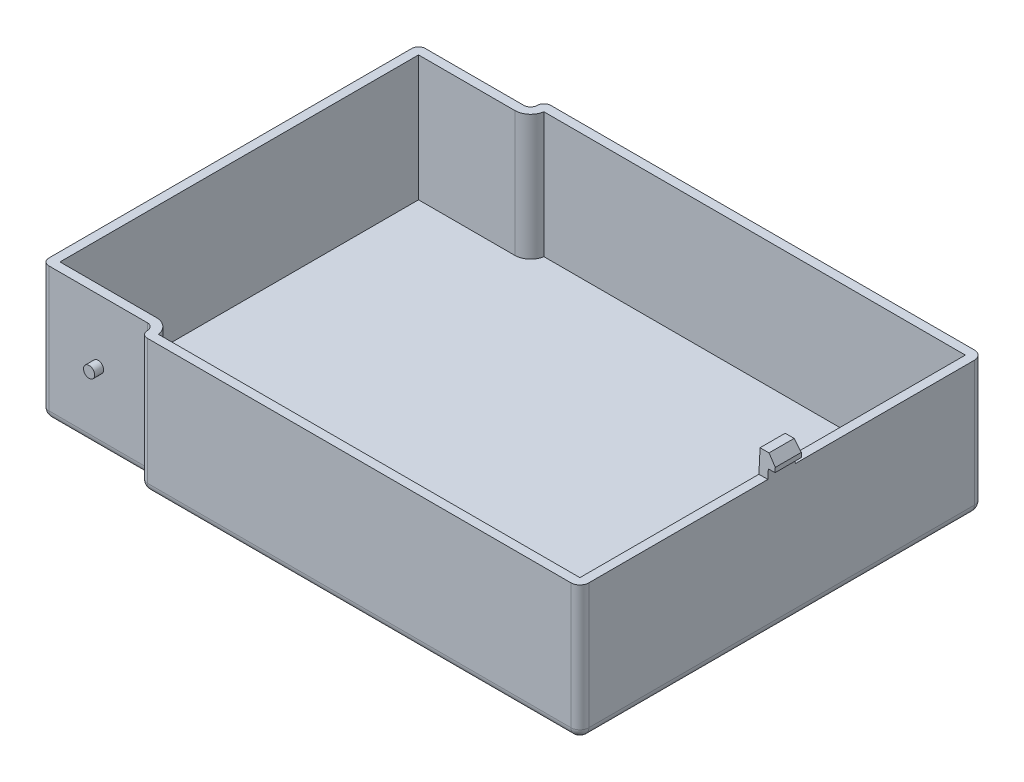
ISO-10303-21;
HEADER;
FILE_DESCRIPTION(('STEP AP214'),'2;1');
FILE_NAME('part.step','',(''),(''),'','','');
FILE_SCHEMA(('AUTOMOTIVE_DESIGN { 1 0 10303 214 1 1 1 1 }'));
ENDSEC;
DATA;
#1=APPLICATION_CONTEXT('core data for automotive mechanical design processes');
#2=APPLICATION_PROTOCOL_DEFINITION('international standard','automotive_design',2000,#1);
#3=PRODUCT_CONTEXT('',#1,'mechanical');
#4=PRODUCT('Part','Part','',(#3));
#5=PRODUCT_RELATED_PRODUCT_CATEGORY('part','',(#4));
#6=PRODUCT_DEFINITION_FORMATION('','',#4);
#7=PRODUCT_DEFINITION_CONTEXT('part definition',#1,'design');
#8=PRODUCT_DEFINITION('design','',#6,#7);
#9=PRODUCT_DEFINITION_SHAPE('','',#8);
#10=(LENGTH_UNIT() NAMED_UNIT(*) SI_UNIT(.MILLI.,.METRE.));
#11=(NAMED_UNIT(*) PLANE_ANGLE_UNIT() SI_UNIT($,.RADIAN.));
#12=(NAMED_UNIT(*) SI_UNIT($,.STERADIAN.) SOLID_ANGLE_UNIT());
#13=UNCERTAINTY_MEASURE_WITH_UNIT(LENGTH_MEASURE(1.E-05),#10,'distance_accuracy_value','');
#14=(GEOMETRIC_REPRESENTATION_CONTEXT(3) GLOBAL_UNCERTAINTY_ASSIGNED_CONTEXT((#13)) GLOBAL_UNIT_ASSIGNED_CONTEXT((#10,
#11,#12)) REPRESENTATION_CONTEXT('',''));
#15=CARTESIAN_POINT('',(0.,0.,0.));
#16=DIRECTION('',(0.,0.,1.));
#17=DIRECTION('',(1.,0.,0.));
#18=AXIS2_PLACEMENT_3D('',#15,#16,#17);
#19=CARTESIAN_POINT('',(61.5,30.,-45.));
#20=DIRECTION('',(0.,-1.,0.));
#21=DIRECTION('',(0.,0.,-1.));
#22=AXIS2_PLACEMENT_3D('',#19,#20,#21);
#23=PLANE('',#22);
#24=DIRECTION('',(-1.,0.,0.));
#25=VECTOR('',#24,1.);
#26=CARTESIAN_POINT('',(59.5,30.,-3.06203889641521));
#27=LINE('',#26,#25);
#28=CARTESIAN_POINT('',(61.5,30.,-3.06203889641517));
#29=VERTEX_POINT('',#28);
#30=CARTESIAN_POINT('',(59.5,30.,-3.0620388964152));
#31=VERTEX_POINT('',#30);
#32=EDGE_CURVE('E326',#29,#31,#27,.T.);
#33=ORIENTED_EDGE('',*,*,#32,.F.);
#34=DIRECTION('',(0.,0.,-1.));
#35=VECTOR('',#34,1.);
#36=CARTESIAN_POINT('',(61.5,30.,45.));
#37=LINE('',#36,#35);
#38=CARTESIAN_POINT('',(61.5,30.,-43.));
#39=VERTEX_POINT('',#38);
#40=EDGE_CURVE('E342',#29,#39,#37,.T.);
#41=ORIENTED_EDGE('',*,*,#40,.T.);
#42=CARTESIAN_POINT('',(59.5,30.,-43.));
#43=DIRECTION('',(0.,-1.,0.));
#44=DIRECTION('',(0.,0.,-1.));
#45=AXIS2_PLACEMENT_3D('',#42,#43,#44);
#46=CIRCLE('',#45,2.);
#47=CARTESIAN_POINT('',(59.5,30.,-45.));
#48=VERTEX_POINT('',#47);
#49=EDGE_CURVE('E419',#39,#48,#46,.F.);
#50=ORIENTED_EDGE('',*,*,#49,.T.);
#51=DIRECTION('',(-1.,0.,0.));
#52=VECTOR('',#51,1.);
#53=CARTESIAN_POINT('',(-36.5,30.,-45.));
#54=LINE('',#53,#52);
#55=CARTESIAN_POINT('',(-35.,30.,-45.));
#56=VERTEX_POINT('',#55);
#57=EDGE_CURVE('E349',#48,#56,#54,.T.);
#58=ORIENTED_EDGE('',*,*,#57,.T.);
#59=CARTESIAN_POINT('',(-35.,30.,-43.5));
#60=DIRECTION('',(0.,-1.,0.));
#61=DIRECTION('',(0.,0.,-1.));
#62=AXIS2_PLACEMENT_3D('',#59,#60,#61);
#63=CIRCLE('',#62,1.5);
#64=CARTESIAN_POINT('',(-36.5,30.,-43.5));
#65=VERTEX_POINT('',#64);
#66=EDGE_CURVE('E383',#56,#65,#63,.F.);
#67=ORIENTED_EDGE('',*,*,#66,.T.);
#68=CARTESIAN_POINT('',(-38.,30.,-43.5));
#69=DIRECTION('',(0.,-1.,0.));
#70=DIRECTION('',(0.,0.,-1.));
#71=AXIS2_PLACEMENT_3D('',#68,#69,#70);
#72=CIRCLE('',#71,1.5);
#73=CARTESIAN_POINT('',(-38.,30.,-42.));
#74=VERTEX_POINT('',#73);
#75=EDGE_CURVE('E404',#65,#74,#72,.T.);
#76=ORIENTED_EDGE('',*,*,#75,.T.);
#77=DIRECTION('',(-1.,0.,0.));
#78=VECTOR('',#77,1.);
#79=CARTESIAN_POINT('',(-36.5,30.,-42.));
#80=LINE('',#79,#78);
#81=CARTESIAN_POINT('',(-60.,30.,-42.));
#82=VERTEX_POINT('',#81);
#83=EDGE_CURVE('E363',#74,#82,#80,.T.);
#84=ORIENTED_EDGE('',*,*,#83,.T.);
#85=CARTESIAN_POINT('',(-60.,30.,-40.5));
#86=DIRECTION('',(0.,-1.,0.));
#87=DIRECTION('',(0.,0.,-1.));
#88=AXIS2_PLACEMENT_3D('',#85,#86,#87);
#89=CIRCLE('',#88,1.5);
#90=CARTESIAN_POINT('',(-61.5,30.,-40.5));
#91=VERTEX_POINT('',#90);
#92=EDGE_CURVE('E379',#82,#91,#89,.F.);
#93=ORIENTED_EDGE('',*,*,#92,.T.);
#94=DIRECTION('',(0.,0.,1.));
#95=VECTOR('',#94,1.);
#96=CARTESIAN_POINT('',(-61.5,30.,42.));
#97=LINE('',#96,#95);
#98=CARTESIAN_POINT('',(-61.5,30.,40.5));
#99=VERTEX_POINT('',#98);
#100=EDGE_CURVE('E366',#91,#99,#97,.T.);
#101=ORIENTED_EDGE('',*,*,#100,.T.);
#102=CARTESIAN_POINT('',(-60.,30.,40.5));
#103=DIRECTION('',(0.,-1.,0.));
#104=DIRECTION('',(0.,0.,-1.));
#105=AXIS2_PLACEMENT_3D('',#102,#103,#104);
#106=CIRCLE('',#105,1.5);
#107=CARTESIAN_POINT('',(-60.,30.,42.));
#108=VERTEX_POINT('',#107);
#109=EDGE_CURVE('E377',#99,#108,#106,.F.);
#110=ORIENTED_EDGE('',*,*,#109,.T.);
#111=DIRECTION('',(1.,0.,0.));
#112=VECTOR('',#111,1.);
#113=CARTESIAN_POINT('',(-36.5,30.,42.));
#114=LINE('',#113,#112);
#115=CARTESIAN_POINT('',(-38.,30.,42.));
#116=VERTEX_POINT('',#115);
#117=EDGE_CURVE('E369',#108,#116,#114,.T.);
#118=ORIENTED_EDGE('',*,*,#117,.T.);
#119=CARTESIAN_POINT('',(-38.,30.,43.5));
#120=DIRECTION('',(0.,-1.,0.));
#121=DIRECTION('',(0.,0.,-1.));
#122=AXIS2_PLACEMENT_3D('',#119,#120,#121);
#123=CIRCLE('',#122,1.5);
#124=CARTESIAN_POINT('',(-36.5,30.,43.5));
#125=VERTEX_POINT('',#124);
#126=EDGE_CURVE('E406',#116,#125,#123,.T.);
#127=ORIENTED_EDGE('',*,*,#126,.T.);
#128=CARTESIAN_POINT('',(-35.,30.,43.5));
#129=DIRECTION('',(0.,-1.,0.));
#130=DIRECTION('',(0.,0.,-1.));
#131=AXIS2_PLACEMENT_3D('',#128,#129,#130);
#132=CIRCLE('',#131,1.5);
#133=CARTESIAN_POINT('',(-35.,30.,45.));
#134=VERTEX_POINT('',#133);
#135=EDGE_CURVE('E381',#125,#134,#132,.F.);
#136=ORIENTED_EDGE('',*,*,#135,.T.);
#137=DIRECTION('',(1.,0.,0.));
#138=VECTOR('',#137,1.);
#139=CARTESIAN_POINT('',(-36.5,30.,45.));
#140=LINE('',#139,#138);
#141=CARTESIAN_POINT('',(59.5,30.,45.));
#142=VERTEX_POINT('',#141);
#143=EDGE_CURVE('E372',#134,#142,#140,.T.);
#144=ORIENTED_EDGE('',*,*,#143,.T.);
#145=CARTESIAN_POINT('',(59.5,30.,43.));
#146=DIRECTION('',(0.,-1.,0.));
#147=DIRECTION('',(0.,0.,-1.));
#148=AXIS2_PLACEMENT_3D('',#145,#146,#147);
#149=CIRCLE('',#148,2.);
#150=CARTESIAN_POINT('',(61.5,30.,43.));
#151=VERTEX_POINT('',#150);
#152=EDGE_CURVE('E417',#142,#151,#149,.F.);
#153=ORIENTED_EDGE('',*,*,#152,.T.);
#154=CARTESIAN_POINT('',(61.5,30.,3.06203889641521));
#155=VERTEX_POINT('',#154);
#156=EDGE_CURVE('E346',#151,#155,#37,.T.);
#157=ORIENTED_EDGE('',*,*,#156,.T.);
#158=DIRECTION('',(1.,0.,0.));
#159=VECTOR('',#158,1.);
#160=CARTESIAN_POINT('',(59.5,30.,3.0620388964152));
#161=LINE('',#160,#159);
#162=CARTESIAN_POINT('',(59.5,30.,3.0620388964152));
#163=VERTEX_POINT('',#162);
#164=EDGE_CURVE('E66',#163,#155,#161,.T.);
#165=ORIENTED_EDGE('',*,*,#164,.F.);
#166=DIRECTION('',(0.,0.,-1.));
#167=VECTOR('',#166,1.);
#168=CARTESIAN_POINT('',(59.5,30.,-45.));
#169=LINE('',#168,#167);
#170=CARTESIAN_POINT('',(59.5,30.,43.));
#171=VERTEX_POINT('',#170);
#172=EDGE_CURVE('E354',#171,#163,#169,.T.);
#173=ORIENTED_EDGE('',*,*,#172,.F.);
#174=DIRECTION('',(1.,0.,0.));
#175=VECTOR('',#174,1.);
#176=CARTESIAN_POINT('',(61.5,30.,43.));
#177=LINE('',#176,#175);
#178=CARTESIAN_POINT('',(-34.5358983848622,30.,43.));
#179=VERTEX_POINT('',#178);
#180=EDGE_CURVE('E358',#179,#171,#177,.T.);
#181=ORIENTED_EDGE('',*,*,#180,.F.);
#182=CARTESIAN_POINT('',(-38.,30.,43.5));
#183=DIRECTION('',(0.,-1.,0.));
#184=DIRECTION('',(0.,0.,-1.));
#185=AXIS2_PLACEMENT_3D('',#182,#183,#184);
#186=CIRCLE('',#185,3.5);
#187=CARTESIAN_POINT('',(-38.,30.,40.));
#188=VERTEX_POINT('',#187);
#189=EDGE_CURVE('E1180',#188,#179,#186,.T.);
#190=ORIENTED_EDGE('',*,*,#189,.F.);
#191=DIRECTION('',(1.,0.,0.));
#192=VECTOR('',#191,1.);
#193=CARTESIAN_POINT('',(61.5,30.,40.));
#194=LINE('',#193,#192);
#195=CARTESIAN_POINT('',(-59.5,30.,40.));
#196=VERTEX_POINT('',#195);
#197=EDGE_CURVE('E1137',#196,#188,#194,.T.);
#198=ORIENTED_EDGE('',*,*,#197,.F.);
#199=DIRECTION('',(0.,0.,1.));
#200=VECTOR('',#199,1.);
#201=CARTESIAN_POINT('',(-59.5,30.,-45.));
#202=LINE('',#201,#200);
#203=CARTESIAN_POINT('',(-59.5,30.,-40.));
#204=VERTEX_POINT('',#203);
#205=EDGE_CURVE('E1183',#204,#196,#202,.T.);
#206=ORIENTED_EDGE('',*,*,#205,.F.);
#207=DIRECTION('',(-1.,0.,0.));
#208=VECTOR('',#207,1.);
#209=CARTESIAN_POINT('',(61.5,30.,-40.));
#210=LINE('',#209,#208);
#211=CARTESIAN_POINT('',(-38.,30.,-40.));
#212=VERTEX_POINT('',#211);
#213=EDGE_CURVE('E1140',#212,#204,#210,.T.);
#214=ORIENTED_EDGE('',*,*,#213,.F.);
#215=CARTESIAN_POINT('',(-38.,30.,-43.5));
#216=DIRECTION('',(0.,-1.,0.));
#217=DIRECTION('',(0.,0.,-1.));
#218=AXIS2_PLACEMENT_3D('',#215,#216,#217);
#219=CIRCLE('',#218,3.5);
#220=CARTESIAN_POINT('',(-34.5358983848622,30.,-43.));
#221=VERTEX_POINT('',#220);
#222=EDGE_CURVE('E1174',#221,#212,#219,.T.);
#223=ORIENTED_EDGE('',*,*,#222,.F.);
#224=DIRECTION('',(-1.,0.,0.));
#225=VECTOR('',#224,1.);
#226=CARTESIAN_POINT('',(61.5,30.,-43.));
#227=LINE('',#226,#225);
#228=CARTESIAN_POINT('',(59.5,30.,-43.));
#229=VERTEX_POINT('',#228);
#230=EDGE_CURVE('E1138',#229,#221,#227,.T.);
#231=ORIENTED_EDGE('',*,*,#230,.F.);
#232=EDGE_CURVE('E59',#31,#229,#169,.T.);
#233=ORIENTED_EDGE('',*,*,#232,.F.);
#234=EDGE_LOOP('',(#33,#41,#50,#58,#67,#76,#84,#93,#101,#110,#118,#127,#136,#144,#153,#157,#165,
#173,#181,#190,#198,#206,#214,#223,#231,#233));
#235=FACE_BOUND('',#234,.T.);
#236=ADVANCED_FACE('F41',(#235),#23,.F.);
#237=CARTESIAN_POINT('',(61.5,30.,45.));
#238=DIRECTION('',(-1.,0.,0.));
#239=DIRECTION('',(0.,0.,1.));
#240=AXIS2_PLACEMENT_3D('',#237,#238,#239);
#241=PLANE('',#240);
#242=DIRECTION('',(0.,-1.,0.));
#243=VECTOR('',#242,1.);
#244=CARTESIAN_POINT('',(61.5,30.,43.));
#245=LINE('',#244,#243);
#246=CARTESIAN_POINT('',(61.5,2.,43.));
#247=VERTEX_POINT('',#246);
#248=EDGE_CURVE('E414',#151,#247,#245,.T.);
#249=ORIENTED_EDGE('',*,*,#248,.T.);
#250=DIRECTION('',(0.,0.,-1.));
#251=VECTOR('',#250,1.);
#252=CARTESIAN_POINT('',(61.5,2.,-43.));
#253=LINE('',#252,#251);
#254=CARTESIAN_POINT('',(61.5,2.,-43.));
#255=VERTEX_POINT('',#254);
#256=EDGE_CURVE('E465',#247,#255,#253,.T.);
#257=ORIENTED_EDGE('',*,*,#256,.T.);
#258=DIRECTION('',(0.,-1.,0.));
#259=VECTOR('',#258,1.);
#260=CARTESIAN_POINT('',(61.5,30.,-43.));
#261=LINE('',#260,#259);
#262=EDGE_CURVE('E344',#255,#39,#261,.F.);
#263=ORIENTED_EDGE('',*,*,#262,.T.);
#264=ORIENTED_EDGE('',*,*,#40,.F.);
#265=DIRECTION('',(0.,-0.998629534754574,-0.0523359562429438));
#266=VECTOR('',#265,1.);
#267=CARTESIAN_POINT('',(61.5,35.,-2.8));
#268=LINE('',#267,#266);
#269=CARTESIAN_POINT('',(61.5,32.,-2.95722333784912));
#270=VERTEX_POINT('',#269);
#271=EDGE_CURVE('E285',#270,#29,#268,.T.);
#272=ORIENTED_EDGE('',*,*,#271,.F.);
#273=DIRECTION('',(0.,0.,-1.));
#274=VECTOR('',#273,1.);
#275=CARTESIAN_POINT('',(61.5,32.,0.));
#276=LINE('',#275,#274);
#277=CARTESIAN_POINT('',(61.5,32.,2.95722333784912));
#278=VERTEX_POINT('',#277);
#279=EDGE_CURVE('E306',#278,#270,#276,.T.);
#280=ORIENTED_EDGE('',*,*,#279,.F.);
#281=DIRECTION('',(0.,0.998629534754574,-0.0523359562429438));
#282=VECTOR('',#281,1.);
#283=CARTESIAN_POINT('',(61.5,35.,2.8));
#284=LINE('',#283,#282);
#285=EDGE_CURVE('E282',#155,#278,#284,.T.);
#286=ORIENTED_EDGE('',*,*,#285,.F.);
#287=ORIENTED_EDGE('',*,*,#156,.F.);
#288=EDGE_LOOP('',(#249,#257,#263,#264,#272,#280,#286,#287));
#289=FACE_BOUND('',#288,.T.);
#290=ADVANCED_FACE('F340',(#289),#241,.F.);
#291=CARTESIAN_POINT('',(-36.5,30.,-45.));
#292=DIRECTION('',(0.,0.,1.));
#293=DIRECTION('',(1.,0.,0.));
#294=AXIS2_PLACEMENT_3D('',#291,#292,#293);
#295=PLANE('',#294);
#296=DIRECTION('',(0.,-1.,0.));
#297=VECTOR('',#296,1.);
#298=CARTESIAN_POINT('',(59.5,30.,-45.));
#299=LINE('',#298,#297);
#300=CARTESIAN_POINT('',(59.5,2.,-45.));
#301=VERTEX_POINT('',#300);
#302=EDGE_CURVE('E407',#48,#301,#299,.T.);
#303=ORIENTED_EDGE('',*,*,#302,.T.);
#304=DIRECTION('',(-1.,0.,0.));
#305=VECTOR('',#304,1.);
#306=CARTESIAN_POINT('',(-35.,2.,-45.));
#307=LINE('',#306,#305);
#308=CARTESIAN_POINT('',(-35.,2.,-45.));
#309=VERTEX_POINT('',#308);
#310=EDGE_CURVE('E459',#301,#309,#307,.T.);
#311=ORIENTED_EDGE('',*,*,#310,.T.);
#312=DIRECTION('',(0.,-1.,0.));
#313=VECTOR('',#312,1.);
#314=CARTESIAN_POINT('',(-35.,30.,-45.));
#315=LINE('',#314,#313);
#316=EDGE_CURVE('E375',#309,#56,#315,.F.);
#317=ORIENTED_EDGE('',*,*,#316,.T.);
#318=ORIENTED_EDGE('',*,*,#57,.F.);
#319=EDGE_LOOP('',(#303,#311,#317,#318));
#320=FACE_BOUND('',#319,.T.);
#321=ADVANCED_FACE('F693',(#320),#295,.F.);
#322=CARTESIAN_POINT('',(-36.5,30.,-42.));
#323=DIRECTION('',(0.,0.,1.));
#324=DIRECTION('',(1.,0.,0.));
#325=AXIS2_PLACEMENT_3D('',#322,#323,#324);
#326=PLANE('',#325);
#327=CARTESIAN_POINT('',(-49.,16.,-42.));
#328=DIRECTION('',(0.,0.,1.));
#329=DIRECTION('',(1.,0.,0.));
#330=AXIS2_PLACEMENT_3D('',#327,#328,#329);
#331=CIRCLE('',#330,1.25);
#332=CARTESIAN_POINT('',(-47.75,16.,-42.));
#333=VERTEX_POINT('',#332);
#334=EDGE_CURVE('E310',#333,#333,#331,.T.);
#335=ORIENTED_EDGE('',*,*,#334,.T.);
#336=EDGE_LOOP('',(#335));
#337=FACE_BOUND('',#336,.T.);
#338=DIRECTION('',(0.,-1.,0.));
#339=VECTOR('',#338,1.);
#340=CARTESIAN_POINT('',(-38.,0.,-42.));
#341=LINE('',#340,#339);
#342=CARTESIAN_POINT('',(-38.,2.,-42.));
#343=VERTEX_POINT('',#342);
#344=EDGE_CURVE('E391',#74,#343,#341,.T.);
#345=ORIENTED_EDGE('',*,*,#344,.T.);
#346=DIRECTION('',(-1.,0.,0.));
#347=VECTOR('',#346,1.);
#348=CARTESIAN_POINT('',(-60.,2.,-42.));
#349=LINE('',#348,#347);
#350=CARTESIAN_POINT('',(-60.,2.,-42.));
#351=VERTEX_POINT('',#350);
#352=EDGE_CURVE('E453',#343,#351,#349,.T.);
#353=ORIENTED_EDGE('',*,*,#352,.T.);
#354=DIRECTION('',(0.,-1.,0.));
#355=VECTOR('',#354,1.);
#356=CARTESIAN_POINT('',(-60.,30.,-42.));
#357=LINE('',#356,#355);
#358=EDGE_CURVE('E389',#351,#82,#357,.F.);
#359=ORIENTED_EDGE('',*,*,#358,.T.);
#360=ORIENTED_EDGE('',*,*,#83,.F.);
#361=EDGE_LOOP('',(#345,#353,#359,#360));
#362=FACE_BOUND('',#361,.T.);
#363=ADVANCED_FACE('F612',(#337,#362),#326,.F.);
#364=CARTESIAN_POINT('',(-61.5,30.,42.));
#365=DIRECTION('',(1.,0.,0.));
#366=DIRECTION('',(0.,0.,-1.));
#367=AXIS2_PLACEMENT_3D('',#364,#365,#366);
#368=PLANE('',#367);
#369=DIRECTION('',(0.,-1.,0.));
#370=VECTOR('',#369,1.);
#371=CARTESIAN_POINT('',(-61.5,30.,-40.5));
#372=LINE('',#371,#370);
#373=CARTESIAN_POINT('',(-61.5,2.,-40.5));
#374=VERTEX_POINT('',#373);
#375=EDGE_CURVE('E396',#91,#374,#372,.T.);
#376=ORIENTED_EDGE('',*,*,#375,.T.);
#377=DIRECTION('',(0.,0.,1.));
#378=VECTOR('',#377,1.);
#379=CARTESIAN_POINT('',(-61.5,2.,40.5));
#380=LINE('',#379,#378);
#381=CARTESIAN_POINT('',(-61.5,2.,40.5));
#382=VERTEX_POINT('',#381);
#383=EDGE_CURVE('E449',#374,#382,#380,.T.);
#384=ORIENTED_EDGE('',*,*,#383,.T.);
#385=DIRECTION('',(0.,-1.,0.));
#386=VECTOR('',#385,1.);
#387=CARTESIAN_POINT('',(-61.5,30.,40.5));
#388=LINE('',#387,#386);
#389=EDGE_CURVE('E394',#382,#99,#388,.F.);
#390=ORIENTED_EDGE('',*,*,#389,.T.);
#391=ORIENTED_EDGE('',*,*,#100,.F.);
#392=EDGE_LOOP('',(#376,#384,#390,#391));
#393=FACE_BOUND('',#392,.T.);
#394=ADVANCED_FACE('F623',(#393),#368,.F.);
#395=CARTESIAN_POINT('',(-36.5,30.,42.));
#396=DIRECTION('',(0.,0.,-1.));
#397=DIRECTION('',(-1.,0.,0.));
#398=AXIS2_PLACEMENT_3D('',#395,#396,#397);
#399=PLANE('',#398);
#400=CARTESIAN_POINT('',(-49.,16.,42.));
#401=DIRECTION('',(0.,0.,-1.));
#402=DIRECTION('',(-1.,0.,0.));
#403=AXIS2_PLACEMENT_3D('',#400,#401,#402);
#404=CIRCLE('',#403,1.25);
#405=CARTESIAN_POINT('',(-50.25,16.,42.));
#406=VERTEX_POINT('',#405);
#407=EDGE_CURVE('E12',#406,#406,#404,.F.);
#408=ORIENTED_EDGE('',*,*,#407,.F.);
#409=EDGE_LOOP('',(#408));
#410=FACE_BOUND('',#409,.T.);
#411=DIRECTION('',(0.,-1.,0.));
#412=VECTOR('',#411,1.);
#413=CARTESIAN_POINT('',(-60.,30.,42.));
#414=LINE('',#413,#412);
#415=CARTESIAN_POINT('',(-60.,2.,42.));
#416=VERTEX_POINT('',#415);
#417=EDGE_CURVE('E401',#108,#416,#414,.T.);
#418=ORIENTED_EDGE('',*,*,#417,.T.);
#419=DIRECTION('',(1.,0.,0.));
#420=VECTOR('',#419,1.);
#421=CARTESIAN_POINT('',(-38.,2.,42.));
#422=LINE('',#421,#420);
#423=CARTESIAN_POINT('',(-38.,2.,42.));
#424=VERTEX_POINT('',#423);
#425=EDGE_CURVE('E445',#416,#424,#422,.T.);
#426=ORIENTED_EDGE('',*,*,#425,.T.);
#427=DIRECTION('',(0.,-1.,0.));
#428=VECTOR('',#427,1.);
#429=CARTESIAN_POINT('',(-38.,30.,42.));
#430=LINE('',#429,#428);
#431=EDGE_CURVE('E399',#424,#116,#430,.F.);
#432=ORIENTED_EDGE('',*,*,#431,.T.);
#433=ORIENTED_EDGE('',*,*,#117,.F.);
#434=EDGE_LOOP('',(#418,#426,#432,#433));
#435=FACE_BOUND('',#434,.T.);
#436=ADVANCED_FACE('F642',(#410,#435),#399,.F.);
#437=CARTESIAN_POINT('',(-36.5,30.,45.));
#438=DIRECTION('',(0.,0.,-1.));
#439=DIRECTION('',(-1.,0.,0.));
#440=AXIS2_PLACEMENT_3D('',#437,#438,#439);
#441=PLANE('',#440);
#442=DIRECTION('',(0.,-1.,0.));
#443=VECTOR('',#442,1.);
#444=CARTESIAN_POINT('',(-35.,30.,45.));
#445=LINE('',#444,#443);
#446=CARTESIAN_POINT('',(-35.,2.,45.));
#447=VERTEX_POINT('',#446);
#448=EDGE_CURVE('E386',#134,#447,#445,.T.);
#449=ORIENTED_EDGE('',*,*,#448,.T.);
#450=DIRECTION('',(1.,0.,0.));
#451=VECTOR('',#450,1.);
#452=CARTESIAN_POINT('',(59.5,2.,45.));
#453=LINE('',#452,#451);
#454=CARTESIAN_POINT('',(59.5,2.,45.));
#455=VERTEX_POINT('',#454);
#456=EDGE_CURVE('E51',#447,#455,#453,.T.);
#457=ORIENTED_EDGE('',*,*,#456,.T.);
#458=DIRECTION('',(0.,-1.,0.));
#459=VECTOR('',#458,1.);
#460=CARTESIAN_POINT('',(59.5,30.,45.));
#461=LINE('',#460,#459);
#462=EDGE_CURVE('E421',#455,#142,#461,.F.);
#463=ORIENTED_EDGE('',*,*,#462,.T.);
#464=ORIENTED_EDGE('',*,*,#143,.F.);
#465=EDGE_LOOP('',(#449,#457,#463,#464));
#466=FACE_BOUND('',#465,.T.);
#467=ADVANCED_FACE('F658',(#466),#441,.F.);
#468=CARTESIAN_POINT('',(61.5,0.,-45.));
#469=DIRECTION('',(0.,-1.,0.));
#470=DIRECTION('',(0.,0.,-1.));
#471=AXIS2_PLACEMENT_3D('',#468,#469,#470);
#472=PLANE('',#471);
#473=DIRECTION('',(1.,0.,0.));
#474=VECTOR('',#473,1.);
#475=CARTESIAN_POINT('',(-35.,0.,43.));
#476=LINE('',#475,#474);
#477=CARTESIAN_POINT('',(59.5,0.,43.));
#478=VERTEX_POINT('',#477);
#479=CARTESIAN_POINT('',(-34.5358983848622,0.,43.));
#480=VERTEX_POINT('',#479);
#481=EDGE_CURVE('E426',#478,#480,#476,.F.);
#482=ORIENTED_EDGE('',*,*,#481,.T.);
#483=CARTESIAN_POINT('',(-38.,0.,43.5));
#484=DIRECTION('',(0.,-1.,0.));
#485=DIRECTION('',(0.,0.,-1.));
#486=AXIS2_PLACEMENT_3D('',#483,#484,#485);
#487=CIRCLE('',#486,3.5);
#488=CARTESIAN_POINT('',(-38.,0.,40.));
#489=VERTEX_POINT('',#488);
#490=EDGE_CURVE('E440',#480,#489,#487,.F.);
#491=ORIENTED_EDGE('',*,*,#490,.T.);
#492=DIRECTION('',(1.,0.,0.));
#493=VECTOR('',#492,1.);
#494=CARTESIAN_POINT('',(-60.,0.,40.));
#495=LINE('',#494,#493);
#496=CARTESIAN_POINT('',(-59.5,0.,40.));
#497=VERTEX_POINT('',#496);
#498=EDGE_CURVE('E438',#489,#497,#495,.F.);
#499=ORIENTED_EDGE('',*,*,#498,.T.);
#500=DIRECTION('',(0.,0.,1.));
#501=VECTOR('',#500,1.);
#502=CARTESIAN_POINT('',(-59.5,0.,-40.5));
#503=LINE('',#502,#501);
#504=CARTESIAN_POINT('',(-59.5,0.,-40.));
#505=VERTEX_POINT('',#504);
#506=EDGE_CURVE('E436',#497,#505,#503,.F.);
#507=ORIENTED_EDGE('',*,*,#506,.T.);
#508=DIRECTION('',(-1.,0.,0.));
#509=VECTOR('',#508,1.);
#510=CARTESIAN_POINT('',(-38.,0.,-40.));
#511=LINE('',#510,#509);
#512=CARTESIAN_POINT('',(-38.,0.,-40.));
#513=VERTEX_POINT('',#512);
#514=EDGE_CURVE('E434',#505,#513,#511,.F.);
#515=ORIENTED_EDGE('',*,*,#514,.T.);
#516=CARTESIAN_POINT('',(-38.,0.,-43.5));
#517=DIRECTION('',(0.,-1.,0.));
#518=DIRECTION('',(0.,0.,-1.));
#519=AXIS2_PLACEMENT_3D('',#516,#517,#518);
#520=CIRCLE('',#519,3.5);
#521=CARTESIAN_POINT('',(-34.5358983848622,0.,-43.));
#522=VERTEX_POINT('',#521);
#523=EDGE_CURVE('E432',#513,#522,#520,.F.);
#524=ORIENTED_EDGE('',*,*,#523,.T.);
#525=DIRECTION('',(-1.,0.,0.));
#526=VECTOR('',#525,1.);
#527=CARTESIAN_POINT('',(59.5,0.,-43.));
#528=LINE('',#527,#526);
#529=CARTESIAN_POINT('',(59.5,0.,-43.));
#530=VERTEX_POINT('',#529);
#531=EDGE_CURVE('E430',#522,#530,#528,.F.);
#532=ORIENTED_EDGE('',*,*,#531,.T.);
#533=DIRECTION('',(0.,0.,-1.));
#534=VECTOR('',#533,1.);
#535=CARTESIAN_POINT('',(59.5,0.,43.));
#536=LINE('',#535,#534);
#537=EDGE_CURVE('E428',#530,#478,#536,.F.);
#538=ORIENTED_EDGE('',*,*,#537,.T.);
#539=EDGE_LOOP('',(#482,#491,#499,#507,#515,#524,#532,#538));
#540=FACE_BOUND('',#539,.T.);
#541=ADVANCED_FACE('F677',(#540),#472,.T.);
#542=CARTESIAN_POINT('',(-38.,30.,-43.5));
#543=DIRECTION('',(0.,1.,0.));
#544=DIRECTION('',(0.,0.,1.));
#545=AXIS2_PLACEMENT_3D('',#542,#543,#544);
#546=CYLINDRICAL_SURFACE('',#545,1.5);
#547=DIRECTION('',(0.,-1.,0.));
#548=VECTOR('',#547,1.);
#549=CARTESIAN_POINT('',(-36.5,30.,-43.5));
#550=LINE('',#549,#548);
#551=CARTESIAN_POINT('',(-36.5,2.,-43.5));
#552=VERTEX_POINT('',#551);
#553=EDGE_CURVE('E347',#552,#65,#550,.F.);
#554=ORIENTED_EDGE('',*,*,#553,.F.);
#555=CARTESIAN_POINT('',(-38.,2.,-43.5));
#556=DIRECTION('',(0.,-1.,0.));
#557=DIRECTION('',(0.,0.,-1.));
#558=AXIS2_PLACEMENT_3D('',#555,#556,#557);
#559=CIRCLE('',#558,1.5);
#560=EDGE_CURVE('E455',#552,#343,#559,.T.);
#561=ORIENTED_EDGE('',*,*,#560,.T.);
#562=ORIENTED_EDGE('',*,*,#344,.F.);
#563=ORIENTED_EDGE('',*,*,#75,.F.);
#564=EDGE_LOOP('',(#554,#561,#562,#563));
#565=FACE_BOUND('',#564,.T.);
#566=ADVANCED_FACE('F608',(#565),#546,.F.);
#567=CARTESIAN_POINT('',(-35.,30.,-43.5));
#568=DIRECTION('',(0.,-1.,0.));
#569=DIRECTION('',(0.,0.,-1.));
#570=AXIS2_PLACEMENT_3D('',#567,#568,#569);
#571=CYLINDRICAL_SURFACE('',#570,1.5);
#572=ORIENTED_EDGE('',*,*,#316,.F.);
#573=CARTESIAN_POINT('',(-35.,2.,-43.5));
#574=DIRECTION('',(0.,1.,0.));
#575=DIRECTION('',(0.,0.,1.));
#576=AXIS2_PLACEMENT_3D('',#573,#574,#575);
#577=CIRCLE('',#576,1.5);
#578=EDGE_CURVE('E457',#309,#552,#577,.T.);
#579=ORIENTED_EDGE('',*,*,#578,.T.);
#580=ORIENTED_EDGE('',*,*,#553,.T.);
#581=ORIENTED_EDGE('',*,*,#66,.F.);
#582=EDGE_LOOP('',(#572,#579,#580,#581));
#583=FACE_BOUND('',#582,.T.);
#584=ADVANCED_FACE('F697',(#583),#571,.T.);
#585=CARTESIAN_POINT('',(-38.,30.,43.5));
#586=DIRECTION('',(0.,1.,0.));
#587=DIRECTION('',(0.,0.,1.));
#588=AXIS2_PLACEMENT_3D('',#585,#586,#587);
#589=CYLINDRICAL_SURFACE('',#588,1.5);
#590=ORIENTED_EDGE('',*,*,#431,.F.);
#591=CARTESIAN_POINT('',(-38.,2.,43.5));
#592=DIRECTION('',(0.,-1.,0.));
#593=DIRECTION('',(0.,0.,-1.));
#594=AXIS2_PLACEMENT_3D('',#591,#592,#593);
#595=CIRCLE('',#594,1.5);
#596=CARTESIAN_POINT('',(-36.5,2.,43.5));
#597=VERTEX_POINT('',#596);
#598=EDGE_CURVE('E443',#424,#597,#595,.T.);
#599=ORIENTED_EDGE('',*,*,#598,.T.);
#600=DIRECTION('',(0.,-1.,0.));
#601=VECTOR('',#600,1.);
#602=CARTESIAN_POINT('',(-36.5,0.,43.5));
#603=LINE('',#602,#601);
#604=EDGE_CURVE('E351',#125,#597,#603,.T.);
#605=ORIENTED_EDGE('',*,*,#604,.F.);
#606=ORIENTED_EDGE('',*,*,#126,.F.);
#607=EDGE_LOOP('',(#590,#599,#605,#606));
#608=FACE_BOUND('',#607,.T.);
#609=ADVANCED_FACE('F647',(#608),#589,.F.);
#610=CARTESIAN_POINT('',(-35.,30.,43.5));
#611=DIRECTION('',(0.,-1.,0.));
#612=DIRECTION('',(0.,0.,-1.));
#613=AXIS2_PLACEMENT_3D('',#610,#611,#612);
#614=CYLINDRICAL_SURFACE('',#613,1.5);
#615=ORIENTED_EDGE('',*,*,#604,.T.);
#616=CARTESIAN_POINT('',(-35.,2.,43.5));
#617=DIRECTION('',(0.,1.,0.));
#618=DIRECTION('',(0.,0.,1.));
#619=AXIS2_PLACEMENT_3D('',#616,#617,#618);
#620=CIRCLE('',#619,1.5);
#621=EDGE_CURVE('E423',#597,#447,#620,.T.);
#622=ORIENTED_EDGE('',*,*,#621,.T.);
#623=ORIENTED_EDGE('',*,*,#448,.F.);
#624=ORIENTED_EDGE('',*,*,#135,.F.);
#625=EDGE_LOOP('',(#615,#622,#623,#624));
#626=FACE_BOUND('',#625,.T.);
#627=ADVANCED_FACE('F654',(#626),#614,.T.);
#628=CARTESIAN_POINT('',(-60.,30.,-40.5));
#629=DIRECTION('',(0.,-1.,0.));
#630=DIRECTION('',(0.,0.,-1.));
#631=AXIS2_PLACEMENT_3D('',#628,#629,#630);
#632=CYLINDRICAL_SURFACE('',#631,1.5);
#633=ORIENTED_EDGE('',*,*,#358,.F.);
#634=CARTESIAN_POINT('',(-60.,2.,-40.5));
#635=DIRECTION('',(0.,1.,0.));
#636=DIRECTION('',(0.,0.,1.));
#637=AXIS2_PLACEMENT_3D('',#634,#635,#636);
#638=CIRCLE('',#637,1.5);
#639=EDGE_CURVE('E451',#351,#374,#638,.T.);
#640=ORIENTED_EDGE('',*,*,#639,.T.);
#641=ORIENTED_EDGE('',*,*,#375,.F.);
#642=ORIENTED_EDGE('',*,*,#92,.F.);
#643=EDGE_LOOP('',(#633,#640,#641,#642));
#644=FACE_BOUND('',#643,.T.);
#645=ADVANCED_FACE('F618',(#644),#632,.T.);
#646=CARTESIAN_POINT('',(-60.,30.,40.5));
#647=DIRECTION('',(0.,-1.,0.));
#648=DIRECTION('',(0.,0.,-1.));
#649=AXIS2_PLACEMENT_3D('',#646,#647,#648);
#650=CYLINDRICAL_SURFACE('',#649,1.5);
#651=ORIENTED_EDGE('',*,*,#389,.F.);
#652=CARTESIAN_POINT('',(-60.,2.,40.5));
#653=DIRECTION('',(0.,1.,0.));
#654=DIRECTION('',(0.,0.,1.));
#655=AXIS2_PLACEMENT_3D('',#652,#653,#654);
#656=CIRCLE('',#655,1.5);
#657=EDGE_CURVE('E447',#382,#416,#656,.T.);
#658=ORIENTED_EDGE('',*,*,#657,.T.);
#659=ORIENTED_EDGE('',*,*,#417,.F.);
#660=ORIENTED_EDGE('',*,*,#109,.F.);
#661=EDGE_LOOP('',(#651,#658,#659,#660));
#662=FACE_BOUND('',#661,.T.);
#663=ADVANCED_FACE('F638',(#662),#650,.T.);
#664=CARTESIAN_POINT('',(59.5,30.,-43.));
#665=DIRECTION('',(0.,-1.,0.));
#666=DIRECTION('',(0.,0.,-1.));
#667=AXIS2_PLACEMENT_3D('',#664,#665,#666);
#668=CYLINDRICAL_SURFACE('',#667,2.);
#669=ORIENTED_EDGE('',*,*,#262,.F.);
#670=CARTESIAN_POINT('',(59.5,2.,-43.));
#671=DIRECTION('',(0.,-1.,0.));
#672=DIRECTION('',(0.,0.,-1.));
#673=AXIS2_PLACEMENT_3D('',#670,#671,#672);
#674=CIRCLE('',#673,2.);
#675=EDGE_CURVE('E461',#255,#301,#674,.F.);
#676=ORIENTED_EDGE('',*,*,#675,.T.);
#677=ORIENTED_EDGE('',*,*,#302,.F.);
#678=ORIENTED_EDGE('',*,*,#49,.F.);
#679=EDGE_LOOP('',(#669,#676,#677,#678));
#680=FACE_BOUND('',#679,.T.);
#681=ADVANCED_FACE('F686',(#680),#668,.T.);
#682=CARTESIAN_POINT('',(59.5,30.,43.));
#683=DIRECTION('',(0.,-1.,0.));
#684=DIRECTION('',(0.,0.,-1.));
#685=AXIS2_PLACEMENT_3D('',#682,#683,#684);
#686=CYLINDRICAL_SURFACE('',#685,2.);
#687=ORIENTED_EDGE('',*,*,#462,.F.);
#688=CARTESIAN_POINT('',(59.5,2.,43.));
#689=DIRECTION('',(0.,-1.,0.));
#690=DIRECTION('',(0.,0.,-1.));
#691=AXIS2_PLACEMENT_3D('',#688,#689,#690);
#692=CIRCLE('',#691,2.);
#693=EDGE_CURVE('E463',#455,#247,#692,.F.);
#694=ORIENTED_EDGE('',*,*,#693,.T.);
#695=ORIENTED_EDGE('',*,*,#248,.F.);
#696=ORIENTED_EDGE('',*,*,#152,.F.);
#697=EDGE_LOOP('',(#687,#694,#695,#696));
#698=FACE_BOUND('',#697,.T.);
#699=ADVANCED_FACE('F663',(#698),#686,.T.);
#700=CARTESIAN_POINT('',(-38.,2.,-43.5));
#701=DIRECTION('',(0.,-1.,0.));
#702=DIRECTION('',(0.,0.,-1.));
#703=AXIS2_PLACEMENT_3D('',#700,#701,#702);
#704=TOROIDAL_SURFACE('',#703,3.5,2.);
#705=CARTESIAN_POINT('',(-38.,2.,-40.));
#706=DIRECTION('',(-1.,0.,0.));
#707=DIRECTION('',(0.,0.,1.));
#708=AXIS2_PLACEMENT_3D('',#705,#706,#707);
#709=CIRCLE('',#708,2.);
#710=EDGE_CURVE('E586',#343,#513,#709,.T.);
#711=ORIENTED_EDGE('',*,*,#710,.F.);
#712=ORIENTED_EDGE('',*,*,#560,.F.);
#713=CARTESIAN_POINT('',(-34.9823965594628,2.52677714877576,-44.9293796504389));
#714=CARTESIAN_POINT('',(-36.3286799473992,2.86685645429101,-44.8365280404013));
#715=CARTESIAN_POINT('',(-36.4294065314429,2.52677714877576,-43.4908109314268));
#716=CARTESIAN_POINT('',(-34.9852474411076,2.48477390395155,-44.9408497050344));
#717=CARTESIAN_POINT('',(-36.3545627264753,2.80555885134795,-44.8612760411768));
#718=CARTESIAN_POINT('',(-36.4408677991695,2.48477390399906,-43.4923611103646));
#719=CARTESIAN_POINT('',(-34.987780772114,2.44208568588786,-44.9510267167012));
#720=CARTESIAN_POINT('',(-36.3782809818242,2.74092173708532,-44.8839298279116));
#721=CARTESIAN_POINT('',(-36.4510390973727,2.44208568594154,-43.4937096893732));
#722=CARTESIAN_POINT('',(-34.9921676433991,2.35557859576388,-44.9686329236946));
#723=CARTESIAN_POINT('',(-36.4204668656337,2.60508959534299,-44.9241955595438));
#724=CARTESIAN_POINT('',(-36.468637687,2.35557859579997,-43.4960132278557));
#725=CARTESIAN_POINT('',(-34.9940208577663,2.31175919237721,-44.9760608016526));
#726=CARTESIAN_POINT('',(-36.4388310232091,2.53400538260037,-44.9417084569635));
#727=CARTESIAN_POINT('',(-36.4760636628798,2.31175919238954,-43.4969679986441));
#728=CARTESIAN_POINT('',(-34.9984749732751,2.17945814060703,-44.9939047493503));
#729=CARTESIAN_POINT('',(-36.4838663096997,2.31291804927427,-44.9846421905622));
#730=CARTESIAN_POINT('',(-36.4939041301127,2.17945814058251,-43.4992465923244));
#731=CARTESIAN_POINT('',(-34.9999991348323,2.08971711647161,-44.999996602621));
#732=CARTESIAN_POINT('',(-36.4999908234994,2.15696608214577,-44.9999913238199));
#733=CARTESIAN_POINT('',(-36.4999965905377,2.08971711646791,-43.4999996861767));
#734=CARTESIAN_POINT('',(-35.0000008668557,1.91010783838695,-45.0000034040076));
#735=CARTESIAN_POINT('',(-36.500009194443,1.84272700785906,-45.0000086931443));
#736=CARTESIAN_POINT('',(-36.5000034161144,1.91010783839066,-43.5000003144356));
#737=CARTESIAN_POINT('',(-34.9984724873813,1.82023967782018,-44.9938945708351));
#738=CARTESIAN_POINT('',(-36.4838400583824,1.6865322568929,-44.984616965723));
#739=CARTESIAN_POINT('',(-36.4938939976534,1.82023967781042,-43.4992449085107));
#740=CARTESIAN_POINT('',(-34.9925141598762,1.6437172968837,-44.9700249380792));
#741=CARTESIAN_POINT('',(-36.4237873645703,1.39256219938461,-44.9273670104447));
#742=CARTESIAN_POINT('',(-36.4700289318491,1.64371729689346,-43.4961976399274));
#743=CARTESIAN_POINT('',(-34.9880848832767,1.55706233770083,-44.9522668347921));
#744=CARTESIAN_POINT('',(-36.3806015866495,1.25626623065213,-44.886174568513));
#745=CARTESIAN_POINT('',(-36.4522759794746,1.55706233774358,-43.4939061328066));
#746=CARTESIAN_POINT('',(-34.9767470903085,1.38995603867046,-44.9066487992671));
#747=CARTESIAN_POINT('',(-36.2782337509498,1.01351960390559,-44.7882923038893));
#748=CARTESIAN_POINT('',(-36.4066932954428,1.389956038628,-43.4877368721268));
#749=CARTESIAN_POINT('',(-34.96985571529,1.30946636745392,-44.8788586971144));
#750=CARTESIAN_POINT('',(-36.2199196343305,0.907231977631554,-44.7324380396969));
#751=CARTESIAN_POINT('',(-36.3789332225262,1.30946636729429,-43.4838700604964));
#752=CARTESIAN_POINT('',(-34.9540433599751,1.15533572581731,-44.8148071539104));
#753=CARTESIAN_POINT('',(-36.0976187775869,0.722953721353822,-44.6148919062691));
#754=CARTESIAN_POINT('',(-36.3149952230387,1.15533572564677,-43.4744600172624));
#755=CARTESIAN_POINT('',(-34.9451200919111,1.08170260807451,-44.7785361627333));
#756=CARTESIAN_POINT('',(-36.0340265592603,0.644624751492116,-44.5535889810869));
#757=CARTESIAN_POINT('',(-36.2788078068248,1.08170260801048,-43.4689148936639));
#758=CARTESIAN_POINT('',(-34.9215554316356,0.912268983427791,-44.68224617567));
#759=CARTESIAN_POINT('',(-35.8818857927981,0.483383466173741,-44.4062476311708));
#760=CARTESIAN_POINT('',(-36.182828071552,0.912268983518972,-43.4533245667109));
#761=CARTESIAN_POINT('',(-34.906094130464,0.820315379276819,-44.6186801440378));
#762=CARTESIAN_POINT('',(-35.7930022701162,0.409870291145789,-44.3196321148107));
#763=CARTESIAN_POINT('',(-36.1195343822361,0.820315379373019,-43.4423682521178));
#764=CARTESIAN_POINT('',(-34.8729412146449,0.651675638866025,-44.4811861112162));
#765=CARTESIAN_POINT('',(-35.6241482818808,0.292093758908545,-44.1536036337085));
#766=CARTESIAN_POINT('',(-35.9828810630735,0.651675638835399,-43.4166428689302));
#767=CARTESIAN_POINT('',(-34.8552435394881,0.575032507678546,-44.4072298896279));
#768=CARTESIAN_POINT('',(-35.5436285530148,0.246654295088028,-44.0737043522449));
#769=CARTESIAN_POINT('',(-35.9094940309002,0.575032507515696,-43.4018633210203));
#770=CARTESIAN_POINT('',(-34.8244139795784,0.45933644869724,-44.277205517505));
#771=CARTESIAN_POINT('',(-35.415886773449,0.184888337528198,-43.9455225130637));
#772=CARTESIAN_POINT('',(-35.7807694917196,0.45933644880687,-43.3738907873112));
#773=CARTESIAN_POINT('',(-34.811680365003,0.416184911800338,-44.2231912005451));
#774=CARTESIAN_POINT('',(-35.3665837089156,0.163838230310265,-43.895664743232));
#775=CARTESIAN_POINT('',(-35.7273722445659,0.416184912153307,-43.3617580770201));
#776=CARTESIAN_POINT('',(-34.785730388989,0.336524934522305,-44.1124257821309));
#777=CARTESIAN_POINT('',(-35.2714902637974,0.127328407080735,-43.7986870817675));
#778=CARTESIAN_POINT('',(-35.6180637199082,0.336524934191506,-43.3357480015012));
#779=CARTESIAN_POINT('',(-34.7725148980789,0.30000516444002,-44.0556795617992));
#780=CARTESIAN_POINT('',(-35.2255100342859,0.111710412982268,-43.7513905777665));
#781=CARTESIAN_POINT('',(-35.5621569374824,0.300005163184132,-43.321873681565));
#782=CARTESIAN_POINT('',(-34.732300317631,0.199954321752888,-43.881905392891));
#783=CARTESIAN_POINT('',(-35.0927278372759,0.0711556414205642,-43.6135541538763));
#784=CARTESIAN_POINT('',(-35.391285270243,0.199954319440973,-43.2776149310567));
#785=CARTESIAN_POINT('',(-34.7047510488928,0.145996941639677,-43.7614173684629));
#786=CARTESIAN_POINT('',(-35.0081076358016,0.0513428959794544,-43.5240505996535));
#787=CARTESIAN_POINT('',(-35.2732438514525,0.14599694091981,-43.2446106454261));
#788=CARTESIAN_POINT('',(-34.6312439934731,0.0364531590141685,-43.4356941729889));
#789=CARTESIAN_POINT('',(-34.79549895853,0.0125599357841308,-43.2945973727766));
#790=CARTESIAN_POINT('',(-34.955650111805,0.036453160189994,-43.1487107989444));
#791=CARTESIAN_POINT('',(-34.5846790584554,0.00148305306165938,-43.2251200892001));
#792=CARTESIAN_POINT('',(-34.6682953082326,0.000517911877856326,-43.1526718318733));
#793=CARTESIAN_POINT('',(-34.751827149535,0.00148305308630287,-43.0801233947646));
#794=CARTESIAN_POINT('',(-34.537860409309,1.54034557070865E-05,-43.0090603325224));
#795=CARTESIAN_POINT('',(-34.5412234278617,5.72723898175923E-06,-43.0061467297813));
#796=CARTESIAN_POINT('',(-34.5445863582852,1.54034551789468E-05,-43.0032330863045));
#797=CARTESIAN_POINT('',(-34.5368792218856,1.10547073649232E-08,-43.0045303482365));
#798=CARTESIAN_POINT('',(-34.5385606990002,2.39136019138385E-07,-43.0030742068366));
#799=CARTESIAN_POINT('',(-34.5402421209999,1.10541680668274E-08,-43.0016180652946));
#800=CARTESIAN_POINT('',(-34.5358983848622,0.,-43.));
#801=CARTESIAN_POINT('',(-34.5358983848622,0.,-43.));
#802=CARTESIAN_POINT('',(-34.5358983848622,0.,-43.));
#803=(BOUNDED_SURFACE() B_SPLINE_SURFACE(3,2,((#713,#714,#715),(#716,#717,#718),(#719,#720,
#721),(#722,#723,#724),(#725,#726,#727),(#728,#729,#730),(#731,#732,#733),(#734,#735,#736),
(#737,#738,#739),(#740,#741,#742),(#743,#744,#745),(#746,#747,#748),(#749,#750,#751),(#752,#753,
#754),(#755,#756,#757),(#758,#759,#760),(#761,#762,#763),(#764,#765,#766),(#767,#768,#769),
(#770,#771,#772),(#773,#774,#775),(#776,#777,#778),(#779,#780,#781),(#782,#783,#784),(#785,#786,
#787),(#788,#789,#790),(#791,#792,#793),(#794,#795,#796),(#797,#798,#799),(#800,#801,#802)),
.UNSPECIFIED.,.F.,.F.,.F.) B_SPLINE_SURFACE_WITH_KNOTS((4,2,2,2,2,2,2,2,2,2,2,2,2,2,4),(3,3),
(0.,0.0337388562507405,0.0674938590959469,0.134673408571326,0.201984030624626,0.269279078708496,
0.336114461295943,0.403025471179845,0.498320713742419,0.59387997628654,0.658206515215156,
0.722422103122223,0.850944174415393,1.06087339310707,1.06536865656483),(0.,1.),
.UNSPECIFIED.) GEOMETRIC_REPRESENTATION_ITEM() RATIONAL_B_SPLINE_SURFACE(((1.,0.733081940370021,
1.),(1.,0.72903001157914,1.),(1.,0.725358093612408,1.),(1.,0.718920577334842,1.),(1.,
0.716155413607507,1.),(1.,0.709466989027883,1.),(1.,0.707108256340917,1.),(1.,0.707105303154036,
1.),(1.,0.709470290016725,1.),(1.,0.718418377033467,1.),(1.,0.725000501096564,1.),(1.,
0.741108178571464,1.),(1.,0.750613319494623,1.),(1.,0.771259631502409,1.),(1.,0.782402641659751,
1.),(1.,0.810027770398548,1.),(1.,0.826769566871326,1.),(1.,0.859135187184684,1.),(1.,
0.874755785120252,1.),(1.,0.898982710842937,1.),(1.,0.908212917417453,1.),(1.,0.925453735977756,
1.),(1.,0.933466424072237,1.),(1.,0.955543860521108,1.),(1.,0.967633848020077,1.),(1.,
0.992051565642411,1.),(1.,0.999679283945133,1.),(1.,0.999996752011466,1.),(1.,1.00000005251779,
1.),(1.,1.,1.))) REPRESENTATION_ITEM('') SURFACE());
#804=CARTESIAN_POINT('',(-36.4294065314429,2.52677714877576,-43.4908109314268));
#805=CARTESIAN_POINT('',(-36.4408677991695,2.48477390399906,-43.4923611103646));
#806=CARTESIAN_POINT('',(-36.4510390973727,2.44208568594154,-43.4937096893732));
#807=CARTESIAN_POINT('',(-36.468637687,2.35557859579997,-43.4960132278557));
#808=CARTESIAN_POINT('',(-36.4760636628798,2.31175919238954,-43.4969679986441));
#809=CARTESIAN_POINT('',(-36.4939041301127,2.17945814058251,-43.4992465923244));
#810=CARTESIAN_POINT('',(-36.4999965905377,2.08971711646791,-43.4999996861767));
#811=CARTESIAN_POINT('',(-36.5000034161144,1.91010783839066,-43.5000003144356));
#812=CARTESIAN_POINT('',(-36.4938939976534,1.82023967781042,-43.4992449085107));
#813=CARTESIAN_POINT('',(-36.4700289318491,1.64371729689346,-43.4961976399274));
#814=CARTESIAN_POINT('',(-36.4522759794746,1.55706233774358,-43.4939061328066));
#815=CARTESIAN_POINT('',(-36.4066932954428,1.389956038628,-43.4877368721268));
#816=CARTESIAN_POINT('',(-36.3789332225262,1.30946636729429,-43.4838700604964));
#817=CARTESIAN_POINT('',(-36.3149952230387,1.15533572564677,-43.4744600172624));
#818=CARTESIAN_POINT('',(-36.2788078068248,1.08170260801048,-43.4689148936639));
#819=CARTESIAN_POINT('',(-36.182828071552,0.912268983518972,-43.4533245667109));
#820=CARTESIAN_POINT('',(-36.1195343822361,0.820315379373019,-43.4423682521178));
#821=CARTESIAN_POINT('',(-35.9828810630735,0.651675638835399,-43.4166428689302));
#822=CARTESIAN_POINT('',(-35.9094940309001,0.575032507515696,-43.4018633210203));
#823=CARTESIAN_POINT('',(-35.7807694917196,0.45933644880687,-43.3738907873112));
#824=CARTESIAN_POINT('',(-35.7273722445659,0.416184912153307,-43.3617580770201));
#825=CARTESIAN_POINT('',(-35.6180637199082,0.336524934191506,-43.3357480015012));
#826=CARTESIAN_POINT('',(-35.5621569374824,0.300005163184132,-43.321873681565));
#827=CARTESIAN_POINT('',(-35.391285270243,0.199954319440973,-43.2776149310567));
#828=CARTESIAN_POINT('',(-35.2732438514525,0.14599694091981,-43.2446106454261));
#829=CARTESIAN_POINT('',(-34.955650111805,0.036453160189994,-43.1487107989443));
#830=CARTESIAN_POINT('',(-34.7518271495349,0.00148305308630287,-43.0801233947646));
#831=CARTESIAN_POINT('',(-34.5445863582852,1.54034551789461E-05,-43.0032330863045));
#832=CARTESIAN_POINT('',(-34.5402421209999,1.1054168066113E-08,-43.0016180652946));
#833=CARTESIAN_POINT('',(-34.5358983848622,0.,-43.));
#834=B_SPLINE_CURVE_WITH_KNOTS('',3,(#804,#805,#806,#807,#808,#809,#810,#811,#812,#813,#814,
#815,#816,#817,#818,#819,#820,#821,#822,#823,#824,#825,#826,#827,#828,#829,#830,#831,#832,#833),
.UNSPECIFIED.,.F.,.F.,(4,2,2,2,2,2,2,2,2,2,2,2,2,2,4),(0.,0.0337388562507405,0.0674938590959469,
0.134673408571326,0.201984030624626,0.269279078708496,0.336114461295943,0.403025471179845,
0.498320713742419,0.59387997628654,0.658206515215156,0.722422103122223,0.850944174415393,
1.06087339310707,1.06536865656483),.UNSPECIFIED.);
#835=EDGE_CURVE('E411',#522,#552,#834,.F.);
#836=ORIENTED_EDGE('',*,*,#835,.F.);
#837=ORIENTED_EDGE('',*,*,#523,.F.);
#838=EDGE_LOOP('',(#711,#712,#836,#837));
#839=FACE_BOUND('',#838,.T.);
#840=ADVANCED_FACE('F575',(#839),#704,.T.);
#841=ORIENTED_EDGE('',*,*,#835,.T.);
#842=ORIENTED_EDGE('',*,*,#578,.F.);
#843=CARTESIAN_POINT('',(-34.9823965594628,2.52677714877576,-44.9293796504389));
#844=CARTESIAN_POINT('',(-34.9852474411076,2.48477390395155,-44.9408497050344));
#845=CARTESIAN_POINT('',(-34.987780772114,2.44208568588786,-44.9510267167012));
#846=CARTESIAN_POINT('',(-34.9921676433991,2.35557859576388,-44.9686329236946));
#847=CARTESIAN_POINT('',(-34.9940208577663,2.31175919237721,-44.9760608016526));
#848=CARTESIAN_POINT('',(-34.9984749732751,2.17945814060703,-44.9939047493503));
#849=CARTESIAN_POINT('',(-34.9999991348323,2.08971711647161,-44.999996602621));
#850=CARTESIAN_POINT('',(-35.0000008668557,1.91010783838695,-45.0000034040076));
#851=CARTESIAN_POINT('',(-34.9984724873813,1.82023967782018,-44.9938945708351));
#852=CARTESIAN_POINT('',(-34.9925141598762,1.6437172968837,-44.9700249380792));
#853=CARTESIAN_POINT('',(-34.9880848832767,1.55706233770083,-44.9522668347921));
#854=CARTESIAN_POINT('',(-34.9767470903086,1.38995603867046,-44.906648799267));
#855=CARTESIAN_POINT('',(-34.96985571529,1.30946636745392,-44.8788586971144));
#856=CARTESIAN_POINT('',(-34.9540433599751,1.15533572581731,-44.8148071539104));
#857=CARTESIAN_POINT('',(-34.9451200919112,1.08170260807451,-44.7785361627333));
#858=CARTESIAN_POINT('',(-34.9215554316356,0.912268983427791,-44.68224617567));
#859=CARTESIAN_POINT('',(-34.906094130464,0.820315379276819,-44.6186801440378));
#860=CARTESIAN_POINT('',(-34.8729412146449,0.651675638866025,-44.4811861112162));
#861=CARTESIAN_POINT('',(-34.8552435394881,0.575032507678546,-44.4072298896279));
#862=CARTESIAN_POINT('',(-34.8244139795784,0.45933644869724,-44.277205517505));
#863=CARTESIAN_POINT('',(-34.811680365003,0.416184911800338,-44.2231912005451));
#864=CARTESIAN_POINT('',(-34.785730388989,0.336524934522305,-44.1124257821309));
#865=CARTESIAN_POINT('',(-34.7725148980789,0.30000516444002,-44.0556795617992));
#866=CARTESIAN_POINT('',(-34.732300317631,0.199954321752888,-43.881905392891));
#867=CARTESIAN_POINT('',(-34.7047510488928,0.145996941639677,-43.7614173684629));
#868=CARTESIAN_POINT('',(-34.6312439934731,0.0364531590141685,-43.4356941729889));
#869=CARTESIAN_POINT('',(-34.5846790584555,0.00148305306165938,-43.2251200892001));
#870=CARTESIAN_POINT('',(-34.537860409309,1.54034557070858E-05,-43.0090603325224));
#871=CARTESIAN_POINT('',(-34.5368792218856,1.10547073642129E-08,-43.0045303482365));
#872=CARTESIAN_POINT('',(-34.5358983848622,0.,-43.));
#873=B_SPLINE_CURVE_WITH_KNOTS('',3,(#843,#844,#845,#846,#847,#848,#849,#850,#851,#852,#853,
#854,#855,#856,#857,#858,#859,#860,#861,#862,#863,#864,#865,#866,#867,#868,#869,#870,#871,#872),
.UNSPECIFIED.,.F.,.F.,(4,2,2,2,2,2,2,2,2,2,2,2,2,2,4),(0.,0.0337388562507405,0.0674938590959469,
0.134673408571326,0.201984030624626,0.269279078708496,0.336114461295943,0.403025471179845,
0.498320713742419,0.59387997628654,0.658206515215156,0.722422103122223,0.850944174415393,
1.06087339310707,1.06536865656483),.UNSPECIFIED.);
#874=EDGE_CURVE('E547',#522,#309,#873,.F.);
#875=ORIENTED_EDGE('',*,*,#874,.F.);
#876=EDGE_LOOP('',(#841,#842,#875));
#877=FACE_BOUND('',#876,.T.);
#878=ADVANCED_FACE('F569',(#877),#803,.T.);
#879=CARTESIAN_POINT('',(-36.5,2.,-40.));
#880=DIRECTION('',(1.,0.,0.));
#881=DIRECTION('',(0.,0.,-1.));
#882=AXIS2_PLACEMENT_3D('',#879,#880,#881);
#883=CYLINDRICAL_SURFACE('',#882,2.);
#884=ORIENTED_EDGE('',*,*,#710,.T.);
#885=ORIENTED_EDGE('',*,*,#514,.F.);
#886=CARTESIAN_POINT('',(-59.5,2.,-40.));
#887=DIRECTION('',(-0.970142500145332,0.,0.242535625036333));
#888=DIRECTION('',(0.242535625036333,0.,0.970142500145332));
#889=AXIS2_PLACEMENT_3D('',#886,#887,#888);
#890=ELLIPSE('',#889,2.06155281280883,2.);
#891=EDGE_CURVE('E544',#351,#505,#890,.T.);
#892=ORIENTED_EDGE('',*,*,#891,.F.);
#893=ORIENTED_EDGE('',*,*,#352,.F.);
#894=EDGE_LOOP('',(#884,#885,#892,#893));
#895=FACE_BOUND('',#894,.T.);
#896=ADVANCED_FACE('F566',(#895),#883,.T.);
#897=CARTESIAN_POINT('',(-36.5,2.,-43.));
#898=DIRECTION('',(1.,0.,0.));
#899=DIRECTION('',(0.,0.,-1.));
#900=AXIS2_PLACEMENT_3D('',#897,#898,#899);
#901=CYLINDRICAL_SURFACE('',#900,2.);
#902=ORIENTED_EDGE('',*,*,#874,.T.);
#903=ORIENTED_EDGE('',*,*,#310,.F.);
#904=CARTESIAN_POINT('',(59.5,2.,-43.));
#905=DIRECTION('',(1.,0.,0.));
#906=DIRECTION('',(0.,0.,-1.));
#907=AXIS2_PLACEMENT_3D('',#904,#905,#906);
#908=CIRCLE('',#907,2.);
#909=EDGE_CURVE('E541',#530,#301,#908,.T.);
#910=ORIENTED_EDGE('',*,*,#909,.F.);
#911=ORIENTED_EDGE('',*,*,#531,.F.);
#912=EDGE_LOOP('',(#902,#903,#910,#911));
#913=FACE_BOUND('',#912,.T.);
#914=ADVANCED_FACE('F564',(#913),#901,.T.);
#915=CARTESIAN_POINT('',(-59.5,0.,-40.));
#916=CARTESIAN_POINT('',(-59.5,0.,-40.));
#917=CARTESIAN_POINT('',(-59.5,0.,-40.));
#918=CARTESIAN_POINT('',(-59.5871294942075,3.50552500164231E-05,-40.0217823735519));
#919=CARTESIAN_POINT('',(-59.5544658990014,6.90468317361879E-05,-40.0544658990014));
#920=CARTESIAN_POINT('',(-59.5217823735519,3.50552500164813E-05,-40.0871294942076));
#921=CARTESIAN_POINT('',(-59.6742812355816,0.0056964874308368,-40.0435703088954));
#922=CARTESIAN_POINT('',(-59.6090831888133,0.00143016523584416,-40.1090831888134));
#923=CARTESIAN_POINT('',(-59.5435703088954,0.00569648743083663,-40.1742812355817));
#924=CARTESIAN_POINT('',(-59.8470859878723,0.0284270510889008,-40.0867714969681));
#925=CARTESIAN_POINT('',(-59.7187583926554,0.00722745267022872,-40.2187583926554));
#926=CARTESIAN_POINT('',(-59.5867714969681,0.0284270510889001,-40.3470859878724));
#927=CARTESIAN_POINT('',(-59.9327454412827,0.0453988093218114,-40.1081863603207));
#928=CARTESIAN_POINT('',(-59.7741252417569,0.0116712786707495,-40.274125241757));
#929=CARTESIAN_POINT('',(-59.6081863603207,0.0453988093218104,-40.4327454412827));
#930=CARTESIAN_POINT('',(-60.1011068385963,0.0905163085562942,-40.1502767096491));
#931=CARTESIAN_POINT('',(-59.8860602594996,0.0241695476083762,-40.3860602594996));
#932=CARTESIAN_POINT('',(-59.6502767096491,0.0905163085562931,-40.6011068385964));
#933=CARTESIAN_POINT('',(-60.1838342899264,0.11846985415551,-40.1709585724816));
#934=CARTESIAN_POINT('',(-59.9429333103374,0.0322384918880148,-40.4429333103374));
#935=CARTESIAN_POINT('',(-59.6709585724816,0.118469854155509,-40.6838342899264));
#936=CARTESIAN_POINT('',(-60.3448909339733,0.185180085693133,-40.2112227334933));
#937=CARTESIAN_POINT('',(-60.0586469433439,0.0531731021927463,-40.5586469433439));
#938=CARTESIAN_POINT('',(-59.7112227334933,0.185180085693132,-40.8448909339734));
#939=CARTESIAN_POINT('',(-60.4232782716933,0.223653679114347,-40.2308195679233));
#940=CARTESIAN_POINT('',(-60.1177814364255,0.0660552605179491,-40.6177814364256));
#941=CARTESIAN_POINT('',(-59.7308195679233,0.223653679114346,-40.9232782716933));
#942=CARTESIAN_POINT('',(-60.5742796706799,0.310834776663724,-40.26856991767));
#943=CARTESIAN_POINT('',(-60.2387097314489,0.0985144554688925,-40.7387097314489));
#944=CARTESIAN_POINT('',(-59.7685699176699,0.310834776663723,-41.0742796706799));
#945=CARTESIAN_POINT('',(-60.6469980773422,0.359177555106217,-40.2867495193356));
#946=CARTESIAN_POINT('',(-60.3007763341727,0.118100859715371,-40.8007763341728));
#947=CARTESIAN_POINT('',(-59.7867495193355,0.359177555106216,-41.1469980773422));
#948=CARTESIAN_POINT('',(-60.7853681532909,0.465353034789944,-40.3213420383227));
#949=CARTESIAN_POINT('',(-60.4279910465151,0.166854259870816,-40.9279910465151));
#950=CARTESIAN_POINT('',(-59.8213420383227,0.465353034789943,-41.2853681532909));
#951=CARTESIAN_POINT('',(-60.8511833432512,0.522755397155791,-40.3377958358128));
#952=CARTESIAN_POINT('',(-60.4933740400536,0.196004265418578,-40.9933740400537));
#953=CARTESIAN_POINT('',(-59.8377958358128,0.52275539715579,-41.3511833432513));
#954=CARTESIAN_POINT('',(-60.9745585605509,0.646132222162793,-40.3686396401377));
#955=CARTESIAN_POINT('',(-60.6269801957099,0.267941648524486,-41.1269801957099));
#956=CARTESIAN_POINT('',(-59.8686396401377,0.646132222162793,-41.4745585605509));
#957=CARTESIAN_POINT('',(-61.0323508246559,0.711637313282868,-40.383087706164));
#958=CARTESIAN_POINT('',(-60.6953761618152,0.31064931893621,-41.1953761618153));
#959=CARTESIAN_POINT('',(-59.883087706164,0.711637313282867,-41.532350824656));
#960=CARTESIAN_POINT('',(-61.1386193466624,0.850132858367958,-40.4096548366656));
#961=CARTESIAN_POINT('',(-60.83344669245,0.414835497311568,-41.33344669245));
#962=CARTESIAN_POINT('',(-59.9096548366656,0.850132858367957,-41.6386193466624));
#963=CARTESIAN_POINT('',(-61.1873975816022,0.92265451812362,-40.4218493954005));
#964=CARTESIAN_POINT('',(-60.9032025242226,0.47610793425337,-41.4032025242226));
#965=CARTESIAN_POINT('',(-59.9218493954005,0.922654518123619,-41.6873975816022));
#966=CARTESIAN_POINT('',(-61.2747319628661,1.07392958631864,-40.4436829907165));
#967=CARTESIAN_POINT('',(-61.0402611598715,0.622797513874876,-41.5402611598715));
#968=CARTESIAN_POINT('',(-59.9436829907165,1.07392958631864,-41.7747319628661));
#969=CARTESIAN_POINT('',(-61.3136444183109,1.15226632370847,-40.4534111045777));
#970=CARTESIAN_POINT('',(-61.1075290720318,0.70778378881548,-41.6075290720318));
#971=CARTESIAN_POINT('',(-59.9534111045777,1.15226632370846,-41.8136444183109));
#972=CARTESIAN_POINT('',(-61.3805305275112,1.31375694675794,-40.4701326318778));
#973=CARTESIAN_POINT('',(-61.2331106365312,0.905428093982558,-41.7331106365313));
#974=CARTESIAN_POINT('',(-59.9701326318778,1.31375694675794,-41.8805305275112));
#975=CARTESIAN_POINT('',(-61.4088745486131,1.39659973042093,-40.4772186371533));
#976=CARTESIAN_POINT('',(-61.2912758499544,1.01730791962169,-41.7912758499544));
#977=CARTESIAN_POINT('',(-59.9772186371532,1.39659973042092,-41.9088745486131));
#978=CARTESIAN_POINT('',(-61.4541388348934,1.56554895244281,-40.4885347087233));
#979=CARTESIAN_POINT('',(-61.3900061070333,1.26720330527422,-41.8900061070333));
#980=CARTESIAN_POINT('',(-59.9885347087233,1.56554895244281,-41.9541388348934));
#981=CARTESIAN_POINT('',(-61.4713765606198,1.65148270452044,-40.492844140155));
#982=CARTESIAN_POINT('',(-61.4303663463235,1.40400165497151,-41.9303663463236));
#983=CARTESIAN_POINT('',(-59.9928441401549,1.65148270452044,-41.9713765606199));
#984=CARTESIAN_POINT('',(-61.4942139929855,1.8249775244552,-40.4985534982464));
#985=CARTESIAN_POINT('',(-61.4854388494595,1.69464717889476,-41.9854388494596));
#986=CARTESIAN_POINT('',(-59.9985534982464,1.8249775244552,-41.9942139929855));
#987=CARTESIAN_POINT('',(-61.5,1.9124887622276,-40.5));
#988=CARTESIAN_POINT('',(-61.5,1.84687806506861,-42.));
#989=CARTESIAN_POINT('',(-60.,1.9124887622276,-42.));
#990=CARTESIAN_POINT('',(-61.5,2.0875112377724,-40.5));
#991=CARTESIAN_POINT('',(-61.5,2.15312193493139,-42.));
#992=CARTESIAN_POINT('',(-60.,2.0875112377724,-42.));
#993=CARTESIAN_POINT('',(-61.4942139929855,2.17502247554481,-40.4985534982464));
#994=CARTESIAN_POINT('',(-61.4854388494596,2.30535282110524,-41.9854388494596));
#995=CARTESIAN_POINT('',(-59.9985534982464,2.17502247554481,-41.9942139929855));
#996=CARTESIAN_POINT('',(-61.4713765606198,2.34851729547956,-40.492844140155));
#997=CARTESIAN_POINT('',(-61.4303663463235,2.59599834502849,-41.9303663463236));
#998=CARTESIAN_POINT('',(-59.9928441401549,2.34851729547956,-41.9713765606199));
#999=CARTESIAN_POINT('',(-61.4541388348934,2.43445104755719,-40.4885347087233));
#1000=CARTESIAN_POINT('',(-61.3900061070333,2.73279669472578,-41.8900061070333));
#1001=CARTESIAN_POINT('',(-59.9885347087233,2.43445104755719,-41.9541388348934));
#1002=CARTESIAN_POINT('',(-61.4088745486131,2.60340026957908,-40.4772186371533));
#1003=CARTESIAN_POINT('',(-61.2912758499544,2.98269208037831,-41.7912758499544));
#1004=CARTESIAN_POINT('',(-59.9772186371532,2.60340026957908,-41.9088745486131));
#1005=CARTESIAN_POINT('',(-61.3805305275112,2.68624305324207,-40.4701326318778));
#1006=CARTESIAN_POINT('',(-61.2331106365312,3.09457190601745,-41.7331106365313));
#1007=CARTESIAN_POINT('',(-59.9701326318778,2.68624305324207,-41.8805305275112));
#1008=CARTESIAN_POINT('',(-61.3136444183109,2.84773367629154,-40.4534111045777));
#1009=CARTESIAN_POINT('',(-61.1075290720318,3.29221621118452,-41.6075290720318));
#1010=CARTESIAN_POINT('',(-59.9534111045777,2.84773367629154,-41.8136444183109));
#1011=CARTESIAN_POINT('',(-61.2747319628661,2.92607041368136,-40.4436829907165));
#1012=CARTESIAN_POINT('',(-61.0402611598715,3.37720248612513,-41.5402611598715));
#1013=CARTESIAN_POINT('',(-59.9436829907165,2.92607041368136,-41.7747319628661));
#1014=CARTESIAN_POINT('',(-61.1873975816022,3.07734548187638,-40.4218493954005));
#1015=CARTESIAN_POINT('',(-60.9032025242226,3.52389206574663,-41.4032025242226));
#1016=CARTESIAN_POINT('',(-59.9218493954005,3.07734548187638,-41.6873975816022));
#1017=CARTESIAN_POINT('',(-61.1386193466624,3.14986714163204,-40.4096548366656));
#1018=CARTESIAN_POINT('',(-60.83344669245,3.58516450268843,-41.33344669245));
#1019=CARTESIAN_POINT('',(-59.9096548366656,3.14986714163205,-41.6386193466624));
#1020=CARTESIAN_POINT('',(-61.0323508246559,3.28836268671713,-40.383087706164));
#1021=CARTESIAN_POINT('',(-60.6953761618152,3.68935068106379,-41.1953761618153));
#1022=CARTESIAN_POINT('',(-59.883087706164,3.28836268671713,-41.532350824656));
#1023=CARTESIAN_POINT('',(-60.9745585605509,3.35386777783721,-40.3686396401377));
#1024=CARTESIAN_POINT('',(-60.6269801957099,3.73205835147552,-41.1269801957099));
#1025=CARTESIAN_POINT('',(-59.8686396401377,3.35386777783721,-41.4745585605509));
#1026=CARTESIAN_POINT('',(-60.8511833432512,3.47724460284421,-40.3377958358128));
#1027=CARTESIAN_POINT('',(-60.4933740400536,3.80399573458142,-40.9933740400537));
#1028=CARTESIAN_POINT('',(-59.8377958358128,3.47724460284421,-41.3511833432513));
#1029=CARTESIAN_POINT('',(-60.7853681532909,3.53464696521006,-40.3213420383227));
#1030=CARTESIAN_POINT('',(-60.4279910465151,3.83314574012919,-40.9279910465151));
#1031=CARTESIAN_POINT('',(-59.8213420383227,3.53464696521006,-41.2853681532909));
#1032=CARTESIAN_POINT('',(-60.6469980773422,3.64082244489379,-40.2867495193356));
#1033=CARTESIAN_POINT('',(-60.3007763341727,3.88189914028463,-40.8007763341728));
#1034=CARTESIAN_POINT('',(-59.7867495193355,3.64082244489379,-41.1469980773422));
#1035=CARTESIAN_POINT('',(-60.5742796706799,3.68916522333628,-40.26856991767));
#1036=CARTESIAN_POINT('',(-60.2387097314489,3.90148554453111,-40.7387097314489));
#1037=CARTESIAN_POINT('',(-59.7685699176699,3.68916522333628,-41.0742796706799));
#1038=CARTESIAN_POINT('',(-60.4232782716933,3.77634632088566,-40.2308195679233));
#1039=CARTESIAN_POINT('',(-60.1177814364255,3.93394473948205,-40.6177814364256));
#1040=CARTESIAN_POINT('',(-59.7308195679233,3.77634632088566,-40.9232782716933));
#1041=CARTESIAN_POINT('',(-60.3448909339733,3.81481991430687,-40.2112227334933));
#1042=CARTESIAN_POINT('',(-60.0586469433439,3.94682689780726,-40.5586469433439));
#1043=CARTESIAN_POINT('',(-59.7112227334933,3.81481991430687,-40.8448909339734));
#1044=CARTESIAN_POINT('',(-60.1838342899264,3.88153014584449,-40.1709585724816));
#1045=CARTESIAN_POINT('',(-59.9429333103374,3.96776150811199,-40.4429333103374));
#1046=CARTESIAN_POINT('',(-59.6709585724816,3.88153014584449,-40.6838342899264));
#1047=CARTESIAN_POINT('',(-60.1011068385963,3.90948369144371,-40.1502767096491));
#1048=CARTESIAN_POINT('',(-59.8860602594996,3.97583045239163,-40.3860602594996));
#1049=CARTESIAN_POINT('',(-59.6502767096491,3.90948369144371,-40.6011068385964));
#1050=CARTESIAN_POINT('',(-59.9327454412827,3.95460119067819,-40.1081863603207));
#1051=CARTESIAN_POINT('',(-59.7741252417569,3.98832872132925,-40.274125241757));
#1052=CARTESIAN_POINT('',(-59.6081863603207,3.95460119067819,-40.4327454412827));
#1053=CARTESIAN_POINT('',(-59.8470859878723,3.9715729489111,-40.0867714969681));
#1054=CARTESIAN_POINT('',(-59.7187583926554,3.99277254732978,-40.2187583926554));
#1055=CARTESIAN_POINT('',(-59.5867714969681,3.9715729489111,-40.3470859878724));
#1056=CARTESIAN_POINT('',(-59.6742812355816,3.99430351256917,-40.0435703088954));
#1057=CARTESIAN_POINT('',(-59.6090831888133,3.99856983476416,-40.1090831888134));
#1058=CARTESIAN_POINT('',(-59.5435703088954,3.99430351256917,-40.1742812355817));
#1059=CARTESIAN_POINT('',(-59.5871294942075,3.99996494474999,-40.0217823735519));
#1060=CARTESIAN_POINT('',(-59.5544658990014,3.99993095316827,-40.0544658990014));
#1061=CARTESIAN_POINT('',(-59.5217823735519,3.99996494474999,-40.0871294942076));
#1062=CARTESIAN_POINT('',(-59.5,4.,-40.));
#1063=CARTESIAN_POINT('',(-59.5,4.,-40.));
#1064=CARTESIAN_POINT('',(-59.5,4.,-40.));
#1065=(BOUNDED_SURFACE() B_SPLINE_SURFACE(3,2,((#915,#916,#917),(#918,#919,#920),(#921,#922,
#923),(#924,#925,#926),(#927,#928,#929),(#930,#931,#932),(#933,#934,#935),(#936,#937,#938),
(#939,#940,#941),(#942,#943,#944),(#945,#946,#947),(#948,#949,#950),(#951,#952,#953),(#954,#955,
#956),(#957,#958,#959),(#960,#961,#962),(#963,#964,#965),(#966,#967,#968),(#969,#970,#971),
(#972,#973,#974),(#975,#976,#977),(#978,#979,#980),(#981,#982,#983),(#984,#985,#986),(#987,#988,
#989),(#990,#991,#992),(#993,#994,#995),(#996,#997,#998),(#999,#1000,#1001),(#1002,#1003,#1004),
(#1005,#1006,#1007),(#1008,#1009,#1010),(#1011,#1012,#1013),(#1014,#1015,#1016),(#1017,#1018,
#1019),(#1020,#1021,#1022),(#1023,#1024,#1025),(#1026,#1027,#1028),(#1029,#1030,#1031),(#1032,
#1033,#1034),(#1035,#1036,#1037),(#1038,#1039,#1040),(#1041,#1042,#1043),(#1044,#1045,#1046),
(#1047,#1048,#1049),(#1050,#1051,#1052),(#1053,#1054,#1055),(#1056,#1057,#1058),(#1059,#1060,
#1061),(#1062,#1063,#1064)),.UNSPECIFIED.,.F.,.F.,.F.) B_SPLINE_SURFACE_WITH_KNOTS((4,2,2,2,2,2,
2,2,2,2,2,2,2,2,2,2,2,2,2,2,2,2,2,2,4),(3,3),(0.,0.0923950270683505,0.184004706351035,
0.274077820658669,0.361932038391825,0.446989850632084,0.528816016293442,0.607156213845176,
0.68197517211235,0.753489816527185,0.822188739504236,0.888824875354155,0.954367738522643,
1.01991060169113,1.08654673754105,1.1552456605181,1.22676030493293,1.30157926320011,
1.37991946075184,1.4617456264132,1.54680343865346,1.63465765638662,1.72473077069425,
1.81634044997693,1.90873547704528),(0.,1.),
.UNSPECIFIED.) GEOMETRIC_REPRESENTATION_ITEM() RATIONAL_B_SPLINE_SURFACE(((1.,1.,1.),(1.,
1.00000566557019,1.),(1.,0.998576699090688,1.),(1.,0.992910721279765,1.),(1.,0.988697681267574,
1.),(1.,0.977617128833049,1.),(1.,0.970795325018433,1.),(1.,0.954789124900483,1.),(1.,
0.945667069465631,1.),(1.,0.92548796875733,1.),(1.,0.914501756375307,1.),(1.,0.891169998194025,
1.),(1.,0.878891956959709,1.),(1.,0.853706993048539,1.),(1.,0.84084914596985,1.),(1.,
0.81538745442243,1.),(1.,0.802798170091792,1.),(1.,0.778880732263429,1.),(1.,0.767521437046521,
1.),(1.,0.747118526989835,1.),(1.,0.738001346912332,1.),(1.,0.723039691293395,1.),(1.,
0.717105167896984,1.),(1.,0.709170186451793,1.),(1.,0.707106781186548,1.),(1.,0.707106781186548,
1.),(1.,0.709170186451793,1.),(1.,0.717105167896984,1.),(1.,0.723039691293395,1.),(1.,
0.738001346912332,1.),(1.,0.747118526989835,1.),(1.,0.767521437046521,1.),(1.,0.778880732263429,
1.),(1.,0.802798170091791,1.),(1.,0.81538745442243,1.),(1.,0.84084914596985,1.),(1.,
0.853706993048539,1.),(1.,0.878891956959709,1.),(1.,0.891169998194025,1.),(1.,0.914501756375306,
1.),(1.,0.92548796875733,1.),(1.,0.945667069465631,1.),(1.,0.954789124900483,1.),(1.,
0.970795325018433,1.),(1.,0.977617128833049,1.),(1.,0.988697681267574,1.),(1.,0.992910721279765,
1.),(1.,0.998576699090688,1.),(1.,1.00000566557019,1.),(1.,1.,1.))) REPRESENTATION_ITEM('') SURFACE());
#1066=ORIENTED_EDGE('',*,*,#639,.F.);
#1067=ORIENTED_EDGE('',*,*,#891,.T.);
#1068=CARTESIAN_POINT('',(-59.5,2.,-40.));
#1069=DIRECTION('',(-0.242535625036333,0.,0.970142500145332));
#1070=DIRECTION('',(0.970142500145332,0.,0.242535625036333));
#1071=AXIS2_PLACEMENT_3D('',#1068,#1069,#1070);
#1072=ELLIPSE('',#1071,2.06155281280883,2.);
#1073=EDGE_CURVE('E538',#374,#505,#1072,.T.);
#1074=ORIENTED_EDGE('',*,*,#1073,.F.);
#1075=EDGE_LOOP('',(#1066,#1067,#1074));
#1076=FACE_BOUND('',#1075,.T.);
#1077=ADVANCED_FACE('F557',(#1076),#1065,.T.);
#1078=CARTESIAN_POINT('',(59.5,2.,-43.));
#1079=DIRECTION('',(0.,0.,1.));
#1080=DIRECTION('',(1.,0.,0.));
#1081=AXIS2_PLACEMENT_3D('',#1078,#1079,#1080);
#1082=SPHERICAL_SURFACE('',#1081,2.);
#1083=ORIENTED_EDGE('',*,*,#909,.T.);
#1084=ORIENTED_EDGE('',*,*,#675,.F.);
#1085=CARTESIAN_POINT('',(59.5,2.,-43.));
#1086=DIRECTION('',(0.,0.,1.));
#1087=DIRECTION('',(1.,0.,0.));
#1088=AXIS2_PLACEMENT_3D('',#1085,#1086,#1087);
#1089=CIRCLE('',#1088,2.);
#1090=EDGE_CURVE('E535',#530,#255,#1089,.T.);
#1091=ORIENTED_EDGE('',*,*,#1090,.F.);
#1092=EDGE_LOOP('',(#1083,#1084,#1091));
#1093=FACE_BOUND('',#1092,.T.);
#1094=ADVANCED_FACE('F563',(#1093),#1082,.T.);
#1095=CARTESIAN_POINT('',(-59.5,2.,42.));
#1096=DIRECTION('',(0.,0.,-1.));
#1097=DIRECTION('',(-1.,0.,0.));
#1098=AXIS2_PLACEMENT_3D('',#1095,#1096,#1097);
#1099=CYLINDRICAL_SURFACE('',#1098,2.);
#1100=ORIENTED_EDGE('',*,*,#1073,.T.);
#1101=ORIENTED_EDGE('',*,*,#506,.F.);
#1102=CARTESIAN_POINT('',(-59.5,2.,40.));
#1103=DIRECTION('',(0.242535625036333,0.,0.970142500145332));
#1104=DIRECTION('',(0.970142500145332,0.,-0.242535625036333));
#1105=AXIS2_PLACEMENT_3D('',#1102,#1103,#1104);
#1106=ELLIPSE('',#1105,2.06155281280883,2.);
#1107=EDGE_CURVE('E533',#382,#497,#1106,.T.);
#1108=ORIENTED_EDGE('',*,*,#1107,.F.);
#1109=ORIENTED_EDGE('',*,*,#383,.F.);
#1110=EDGE_LOOP('',(#1100,#1101,#1108,#1109));
#1111=FACE_BOUND('',#1110,.T.);
#1112=ADVANCED_FACE('F527',(#1111),#1099,.T.);
#1113=CARTESIAN_POINT('',(59.5,2.,45.));
#1114=DIRECTION('',(0.,0.,1.));
#1115=DIRECTION('',(1.,0.,0.));
#1116=AXIS2_PLACEMENT_3D('',#1113,#1114,#1115);
#1117=CYLINDRICAL_SURFACE('',#1116,2.);
#1118=ORIENTED_EDGE('',*,*,#1090,.T.);
#1119=ORIENTED_EDGE('',*,*,#256,.F.);
#1120=CARTESIAN_POINT('',(59.5,2.,43.));
#1121=DIRECTION('',(0.,0.,1.));
#1122=DIRECTION('',(1.,0.,0.));
#1123=AXIS2_PLACEMENT_3D('',#1120,#1121,#1122);
#1124=CIRCLE('',#1123,2.);
#1125=EDGE_CURVE('E633',#478,#247,#1124,.T.);
#1126=ORIENTED_EDGE('',*,*,#1125,.F.);
#1127=ORIENTED_EDGE('',*,*,#537,.F.);
#1128=EDGE_LOOP('',(#1118,#1119,#1126,#1127));
#1129=FACE_BOUND('',#1128,.T.);
#1130=ADVANCED_FACE('F525',(#1129),#1117,.T.);
#1131=CARTESIAN_POINT('',(-59.5,0.,40.));
#1132=CARTESIAN_POINT('',(-59.5,0.,40.));
#1133=CARTESIAN_POINT('',(-59.5,0.,40.));
#1134=CARTESIAN_POINT('',(-59.5217823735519,3.50552500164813E-05,40.0871294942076));
#1135=CARTESIAN_POINT('',(-59.5544658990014,6.90468317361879E-05,40.0544658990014));
#1136=CARTESIAN_POINT('',(-59.5871294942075,3.50552500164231E-05,40.0217823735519));
#1137=CARTESIAN_POINT('',(-59.5435703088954,0.00569648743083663,40.1742812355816));
#1138=CARTESIAN_POINT('',(-59.6090831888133,0.00143016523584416,40.1090831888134));
#1139=CARTESIAN_POINT('',(-59.6742812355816,0.0056964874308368,40.0435703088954));
#1140=CARTESIAN_POINT('',(-59.5867714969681,0.0284270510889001,40.3470859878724));
#1141=CARTESIAN_POINT('',(-59.7187583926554,0.00722745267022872,40.2187583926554));
#1142=CARTESIAN_POINT('',(-59.8470859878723,0.0284270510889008,40.0867714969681));
#1143=CARTESIAN_POINT('',(-59.6081863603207,0.0453988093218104,40.4327454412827));
#1144=CARTESIAN_POINT('',(-59.7741252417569,0.0116712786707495,40.274125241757));
#1145=CARTESIAN_POINT('',(-59.9327454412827,0.0453988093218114,40.1081863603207));
#1146=CARTESIAN_POINT('',(-59.6502767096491,0.0905163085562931,40.6011068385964));
#1147=CARTESIAN_POINT('',(-59.8860602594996,0.0241695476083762,40.3860602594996));
#1148=CARTESIAN_POINT('',(-60.1011068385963,0.0905163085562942,40.1502767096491));
#1149=CARTESIAN_POINT('',(-59.6709585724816,0.118469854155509,40.6838342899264));
#1150=CARTESIAN_POINT('',(-59.9429333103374,0.0322384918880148,40.4429333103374));
#1151=CARTESIAN_POINT('',(-60.1838342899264,0.11846985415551,40.1709585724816));
#1152=CARTESIAN_POINT('',(-59.7112227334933,0.185180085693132,40.8448909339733));
#1153=CARTESIAN_POINT('',(-60.0586469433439,0.0531731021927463,40.5586469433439));
#1154=CARTESIAN_POINT('',(-60.3448909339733,0.185180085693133,40.2112227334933));
#1155=CARTESIAN_POINT('',(-59.7308195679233,0.223653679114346,40.9232782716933));
#1156=CARTESIAN_POINT('',(-60.1177814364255,0.0660552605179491,40.6177814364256));
#1157=CARTESIAN_POINT('',(-60.4232782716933,0.223653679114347,40.2308195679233));
#1158=CARTESIAN_POINT('',(-59.7685699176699,0.310834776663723,41.0742796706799));
#1159=CARTESIAN_POINT('',(-60.2387097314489,0.0985144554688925,40.7387097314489));
#1160=CARTESIAN_POINT('',(-60.5742796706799,0.310834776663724,40.26856991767));
#1161=CARTESIAN_POINT('',(-59.7867495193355,0.359177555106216,41.1469980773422));
#1162=CARTESIAN_POINT('',(-60.3007763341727,0.118100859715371,40.8007763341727));
#1163=CARTESIAN_POINT('',(-60.6469980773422,0.359177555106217,40.2867495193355));
#1164=CARTESIAN_POINT('',(-59.8213420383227,0.465353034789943,41.2853681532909));
#1165=CARTESIAN_POINT('',(-60.4279910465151,0.166854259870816,40.9279910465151));
#1166=CARTESIAN_POINT('',(-60.7853681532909,0.465353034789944,40.3213420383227));
#1167=CARTESIAN_POINT('',(-59.8377958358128,0.52275539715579,41.3511833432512));
#1168=CARTESIAN_POINT('',(-60.4933740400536,0.196004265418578,40.9933740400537));
#1169=CARTESIAN_POINT('',(-60.8511833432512,0.522755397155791,40.3377958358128));
#1170=CARTESIAN_POINT('',(-59.8686396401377,0.646132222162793,41.4745585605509));
#1171=CARTESIAN_POINT('',(-60.6269801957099,0.267941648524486,41.1269801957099));
#1172=CARTESIAN_POINT('',(-60.9745585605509,0.646132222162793,40.3686396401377));
#1173=CARTESIAN_POINT('',(-59.883087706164,0.711637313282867,41.532350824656));
#1174=CARTESIAN_POINT('',(-60.6953761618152,0.31064931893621,41.1953761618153));
#1175=CARTESIAN_POINT('',(-61.0323508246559,0.711637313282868,40.383087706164));
#1176=CARTESIAN_POINT('',(-59.9096548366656,0.850132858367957,41.6386193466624));
#1177=CARTESIAN_POINT('',(-60.83344669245,0.414835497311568,41.33344669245));
#1178=CARTESIAN_POINT('',(-61.1386193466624,0.850132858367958,40.4096548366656));
#1179=CARTESIAN_POINT('',(-59.9218493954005,0.922654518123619,41.6873975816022));
#1180=CARTESIAN_POINT('',(-60.9032025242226,0.47610793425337,41.4032025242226));
#1181=CARTESIAN_POINT('',(-61.1873975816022,0.92265451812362,40.4218493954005));
#1182=CARTESIAN_POINT('',(-59.9436829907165,1.07392958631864,41.7747319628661));
#1183=CARTESIAN_POINT('',(-61.0402611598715,0.622797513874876,41.5402611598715));
#1184=CARTESIAN_POINT('',(-61.2747319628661,1.07392958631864,40.4436829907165));
#1185=CARTESIAN_POINT('',(-59.9534111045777,1.15226632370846,41.8136444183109));
#1186=CARTESIAN_POINT('',(-61.1075290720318,0.70778378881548,41.6075290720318));
#1187=CARTESIAN_POINT('',(-61.3136444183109,1.15226632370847,40.4534111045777));
#1188=CARTESIAN_POINT('',(-59.9701326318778,1.31375694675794,41.8805305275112));
#1189=CARTESIAN_POINT('',(-61.2331106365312,0.905428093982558,41.7331106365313));
#1190=CARTESIAN_POINT('',(-61.3805305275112,1.31375694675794,40.4701326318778));
#1191=CARTESIAN_POINT('',(-59.9772186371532,1.39659973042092,41.9088745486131));
#1192=CARTESIAN_POINT('',(-61.2912758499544,1.01730791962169,41.7912758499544));
#1193=CARTESIAN_POINT('',(-61.4088745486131,1.39659973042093,40.4772186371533));
#1194=CARTESIAN_POINT('',(-59.9885347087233,1.56554895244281,41.9541388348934));
#1195=CARTESIAN_POINT('',(-61.3900061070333,1.26720330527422,41.8900061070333));
#1196=CARTESIAN_POINT('',(-61.4541388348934,1.56554895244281,40.4885347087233));
#1197=CARTESIAN_POINT('',(-59.9928441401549,1.65148270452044,41.9713765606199));
#1198=CARTESIAN_POINT('',(-61.4303663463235,1.40400165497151,41.9303663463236));
#1199=CARTESIAN_POINT('',(-61.4713765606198,1.65148270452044,40.492844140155));
#1200=CARTESIAN_POINT('',(-59.9985534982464,1.8249775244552,41.9942139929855));
#1201=CARTESIAN_POINT('',(-61.4854388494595,1.69464717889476,41.9854388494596));
#1202=CARTESIAN_POINT('',(-61.4942139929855,1.8249775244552,40.4985534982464));
#1203=CARTESIAN_POINT('',(-60.,1.9124887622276,42.));
#1204=CARTESIAN_POINT('',(-61.5,1.84687806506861,42.));
#1205=CARTESIAN_POINT('',(-61.5,1.9124887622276,40.5));
#1206=CARTESIAN_POINT('',(-60.,2.0875112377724,42.));
#1207=CARTESIAN_POINT('',(-61.5,2.15312193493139,42.));
#1208=CARTESIAN_POINT('',(-61.5,2.0875112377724,40.5));
#1209=CARTESIAN_POINT('',(-59.9985534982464,2.17502247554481,41.9942139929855));
#1210=CARTESIAN_POINT('',(-61.4854388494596,2.30535282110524,41.9854388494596));
#1211=CARTESIAN_POINT('',(-61.4942139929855,2.17502247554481,40.4985534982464));
#1212=CARTESIAN_POINT('',(-59.9928441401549,2.34851729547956,41.9713765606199));
#1213=CARTESIAN_POINT('',(-61.4303663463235,2.59599834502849,41.9303663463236));
#1214=CARTESIAN_POINT('',(-61.4713765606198,2.34851729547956,40.492844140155));
#1215=CARTESIAN_POINT('',(-59.9885347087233,2.43445104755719,41.9541388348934));
#1216=CARTESIAN_POINT('',(-61.3900061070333,2.73279669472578,41.8900061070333));
#1217=CARTESIAN_POINT('',(-61.4541388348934,2.43445104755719,40.4885347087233));
#1218=CARTESIAN_POINT('',(-59.9772186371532,2.60340026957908,41.9088745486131));
#1219=CARTESIAN_POINT('',(-61.2912758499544,2.98269208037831,41.7912758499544));
#1220=CARTESIAN_POINT('',(-61.4088745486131,2.60340026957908,40.4772186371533));
#1221=CARTESIAN_POINT('',(-59.9701326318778,2.68624305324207,41.8805305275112));
#1222=CARTESIAN_POINT('',(-61.2331106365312,3.09457190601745,41.7331106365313));
#1223=CARTESIAN_POINT('',(-61.3805305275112,2.68624305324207,40.4701326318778));
#1224=CARTESIAN_POINT('',(-59.9534111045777,2.84773367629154,41.8136444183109));
#1225=CARTESIAN_POINT('',(-61.1075290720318,3.29221621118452,41.6075290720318));
#1226=CARTESIAN_POINT('',(-61.3136444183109,2.84773367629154,40.4534111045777));
#1227=CARTESIAN_POINT('',(-59.9436829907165,2.92607041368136,41.7747319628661));
#1228=CARTESIAN_POINT('',(-61.0402611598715,3.37720248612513,41.5402611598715));
#1229=CARTESIAN_POINT('',(-61.2747319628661,2.92607041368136,40.4436829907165));
#1230=CARTESIAN_POINT('',(-59.9218493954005,3.07734548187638,41.6873975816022));
#1231=CARTESIAN_POINT('',(-60.9032025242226,3.52389206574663,41.4032025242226));
#1232=CARTESIAN_POINT('',(-61.1873975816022,3.07734548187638,40.4218493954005));
#1233=CARTESIAN_POINT('',(-59.9096548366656,3.14986714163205,41.6386193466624));
#1234=CARTESIAN_POINT('',(-60.83344669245,3.58516450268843,41.33344669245));
#1235=CARTESIAN_POINT('',(-61.1386193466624,3.14986714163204,40.4096548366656));
#1236=CARTESIAN_POINT('',(-59.883087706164,3.28836268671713,41.532350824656));
#1237=CARTESIAN_POINT('',(-60.6953761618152,3.68935068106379,41.1953761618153));
#1238=CARTESIAN_POINT('',(-61.0323508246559,3.28836268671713,40.383087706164));
#1239=CARTESIAN_POINT('',(-59.8686396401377,3.35386777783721,41.4745585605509));
#1240=CARTESIAN_POINT('',(-60.6269801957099,3.73205835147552,41.1269801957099));
#1241=CARTESIAN_POINT('',(-60.9745585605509,3.35386777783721,40.3686396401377));
#1242=CARTESIAN_POINT('',(-59.8377958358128,3.47724460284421,41.3511833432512));
#1243=CARTESIAN_POINT('',(-60.4933740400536,3.80399573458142,40.9933740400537));
#1244=CARTESIAN_POINT('',(-60.8511833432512,3.47724460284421,40.3377958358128));
#1245=CARTESIAN_POINT('',(-59.8213420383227,3.53464696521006,41.2853681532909));
#1246=CARTESIAN_POINT('',(-60.4279910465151,3.83314574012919,40.9279910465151));
#1247=CARTESIAN_POINT('',(-60.7853681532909,3.53464696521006,40.3213420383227));
#1248=CARTESIAN_POINT('',(-59.7867495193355,3.64082244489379,41.1469980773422));
#1249=CARTESIAN_POINT('',(-60.3007763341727,3.88189914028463,40.8007763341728));
#1250=CARTESIAN_POINT('',(-60.6469980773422,3.64082244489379,40.2867495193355));
#1251=CARTESIAN_POINT('',(-59.7685699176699,3.68916522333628,41.0742796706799));
#1252=CARTESIAN_POINT('',(-60.2387097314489,3.90148554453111,40.7387097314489));
#1253=CARTESIAN_POINT('',(-60.5742796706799,3.68916522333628,40.26856991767));
#1254=CARTESIAN_POINT('',(-59.7308195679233,3.77634632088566,40.9232782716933));
#1255=CARTESIAN_POINT('',(-60.1177814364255,3.93394473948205,40.6177814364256));
#1256=CARTESIAN_POINT('',(-60.4232782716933,3.77634632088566,40.2308195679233));
#1257=CARTESIAN_POINT('',(-59.7112227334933,3.81481991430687,40.8448909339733));
#1258=CARTESIAN_POINT('',(-60.0586469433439,3.94682689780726,40.5586469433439));
#1259=CARTESIAN_POINT('',(-60.3448909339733,3.81481991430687,40.2112227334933));
#1260=CARTESIAN_POINT('',(-59.6709585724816,3.88153014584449,40.6838342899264));
#1261=CARTESIAN_POINT('',(-59.9429333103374,3.96776150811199,40.4429333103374));
#1262=CARTESIAN_POINT('',(-60.1838342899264,3.88153014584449,40.1709585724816));
#1263=CARTESIAN_POINT('',(-59.6502767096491,3.90948369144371,40.6011068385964));
#1264=CARTESIAN_POINT('',(-59.8860602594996,3.97583045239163,40.3860602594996));
#1265=CARTESIAN_POINT('',(-60.1011068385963,3.90948369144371,40.1502767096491));
#1266=CARTESIAN_POINT('',(-59.6081863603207,3.95460119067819,40.4327454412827));
#1267=CARTESIAN_POINT('',(-59.7741252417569,3.98832872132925,40.274125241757));
#1268=CARTESIAN_POINT('',(-59.9327454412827,3.95460119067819,40.1081863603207));
#1269=CARTESIAN_POINT('',(-59.5867714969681,3.9715729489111,40.3470859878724));
#1270=CARTESIAN_POINT('',(-59.7187583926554,3.99277254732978,40.2187583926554));
#1271=CARTESIAN_POINT('',(-59.8470859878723,3.9715729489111,40.0867714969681));
#1272=CARTESIAN_POINT('',(-59.5435703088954,3.99430351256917,40.1742812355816));
#1273=CARTESIAN_POINT('',(-59.6090831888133,3.99856983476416,40.1090831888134));
#1274=CARTESIAN_POINT('',(-59.6742812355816,3.99430351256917,40.0435703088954));
#1275=CARTESIAN_POINT('',(-59.5217823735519,3.99996494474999,40.0871294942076));
#1276=CARTESIAN_POINT('',(-59.5544658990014,3.99993095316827,40.0544658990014));
#1277=CARTESIAN_POINT('',(-59.5871294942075,3.99996494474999,40.0217823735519));
#1278=CARTESIAN_POINT('',(-59.5,4.,40.));
#1279=CARTESIAN_POINT('',(-59.5,4.,40.));
#1280=CARTESIAN_POINT('',(-59.5,4.,40.));
#1281=(BOUNDED_SURFACE() B_SPLINE_SURFACE(3,2,((#1131,#1132,#1133),(#1134,#1135,#1136),(#1137,
#1138,#1139),(#1140,#1141,#1142),(#1143,#1144,#1145),(#1146,#1147,#1148),(#1149,#1150,#1151),
(#1152,#1153,#1154),(#1155,#1156,#1157),(#1158,#1159,#1160),(#1161,#1162,#1163),(#1164,#1165,
#1166),(#1167,#1168,#1169),(#1170,#1171,#1172),(#1173,#1174,#1175),(#1176,#1177,#1178),(#1179,
#1180,#1181),(#1182,#1183,#1184),(#1185,#1186,#1187),(#1188,#1189,#1190),(#1191,#1192,#1193),
(#1194,#1195,#1196),(#1197,#1198,#1199),(#1200,#1201,#1202),(#1203,#1204,#1205),(#1206,#1207,
#1208),(#1209,#1210,#1211),(#1212,#1213,#1214),(#1215,#1216,#1217),(#1218,#1219,#1220),(#1221,
#1222,#1223),(#1224,#1225,#1226),(#1227,#1228,#1229),(#1230,#1231,#1232),(#1233,#1234,#1235),
(#1236,#1237,#1238),(#1239,#1240,#1241),(#1242,#1243,#1244),(#1245,#1246,#1247),(#1248,#1249,
#1250),(#1251,#1252,#1253),(#1254,#1255,#1256),(#1257,#1258,#1259),(#1260,#1261,#1262),(#1263,
#1264,#1265),(#1266,#1267,#1268),(#1269,#1270,#1271),(#1272,#1273,#1274),(#1275,#1276,#1277),
(#1278,#1279,#1280)),.UNSPECIFIED.,.F.,.F.,.F.) B_SPLINE_SURFACE_WITH_KNOTS((4,2,2,2,2,2,2,2,2,
2,2,2,2,2,2,2,2,2,2,2,2,2,2,2,4),(3,3),(0.,0.0923950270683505,0.184004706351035,
0.274077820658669,0.361932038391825,0.446989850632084,0.528816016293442,0.607156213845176,
0.68197517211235,0.753489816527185,0.822188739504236,0.888824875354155,0.954367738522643,
1.01991060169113,1.08654673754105,1.1552456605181,1.22676030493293,1.30157926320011,
1.37991946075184,1.4617456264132,1.54680343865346,1.63465765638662,1.72473077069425,
1.81634044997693,1.90873547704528),(0.,1.),
.UNSPECIFIED.) GEOMETRIC_REPRESENTATION_ITEM() RATIONAL_B_SPLINE_SURFACE(((1.,1.,1.),(1.,
1.00000566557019,1.),(1.,0.998576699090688,1.),(1.,0.992910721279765,1.),(1.,0.988697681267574,
1.),(1.,0.977617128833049,1.),(1.,0.970795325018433,1.),(1.,0.954789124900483,1.),(1.,
0.945667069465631,1.),(1.,0.92548796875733,1.),(1.,0.914501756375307,1.),(1.,0.891169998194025,
1.),(1.,0.878891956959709,1.),(1.,0.853706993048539,1.),(1.,0.84084914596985,1.),(1.,
0.81538745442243,1.),(1.,0.802798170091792,1.),(1.,0.778880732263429,1.),(1.,0.767521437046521,
1.),(1.,0.747118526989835,1.),(1.,0.738001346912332,1.),(1.,0.723039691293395,1.),(1.,
0.717105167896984,1.),(1.,0.709170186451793,1.),(1.,0.707106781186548,1.),(1.,0.707106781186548,
1.),(1.,0.709170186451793,1.),(1.,0.717105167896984,1.),(1.,0.723039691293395,1.),(1.,
0.738001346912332,1.),(1.,0.747118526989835,1.),(1.,0.767521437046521,1.),(1.,0.778880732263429,
1.),(1.,0.802798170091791,1.),(1.,0.81538745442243,1.),(1.,0.84084914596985,1.),(1.,
0.853706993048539,1.),(1.,0.878891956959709,1.),(1.,0.891169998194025,1.),(1.,0.914501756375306,
1.),(1.,0.92548796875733,1.),(1.,0.945667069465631,1.),(1.,0.954789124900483,1.),(1.,
0.970795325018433,1.),(1.,0.977617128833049,1.),(1.,0.988697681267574,1.),(1.,0.992910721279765,
1.),(1.,0.998576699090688,1.),(1.,1.00000566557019,1.),(1.,1.,1.))) REPRESENTATION_ITEM('') SURFACE());
#1282=ORIENTED_EDGE('',*,*,#657,.F.);
#1283=ORIENTED_EDGE('',*,*,#1107,.T.);
#1284=CARTESIAN_POINT('',(-59.5,2.,40.));
#1285=DIRECTION('',(0.970142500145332,0.,0.242535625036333));
#1286=DIRECTION('',(0.242535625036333,0.,-0.970142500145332));
#1287=AXIS2_PLACEMENT_3D('',#1284,#1285,#1286);
#1288=ELLIPSE('',#1287,2.06155281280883,2.);
#1289=EDGE_CURVE('E634',#416,#497,#1288,.T.);
#1290=ORIENTED_EDGE('',*,*,#1289,.F.);
#1291=EDGE_LOOP('',(#1282,#1283,#1290));
#1292=FACE_BOUND('',#1291,.T.);
#1293=ADVANCED_FACE('F519',(#1292),#1281,.T.);
#1294=CARTESIAN_POINT('',(59.5,2.,43.));
#1295=DIRECTION('',(0.,0.,1.));
#1296=DIRECTION('',(1.,0.,0.));
#1297=AXIS2_PLACEMENT_3D('',#1294,#1295,#1296);
#1298=SPHERICAL_SURFACE('',#1297,2.);
#1299=ORIENTED_EDGE('',*,*,#1125,.T.);
#1300=ORIENTED_EDGE('',*,*,#693,.F.);
#1301=CARTESIAN_POINT('',(59.5,2.,43.));
#1302=DIRECTION('',(-1.,0.,0.));
#1303=DIRECTION('',(0.,0.,1.));
#1304=AXIS2_PLACEMENT_3D('',#1301,#1302,#1303);
#1305=CIRCLE('',#1304,2.);
#1306=EDGE_CURVE('E669',#478,#455,#1305,.T.);
#1307=ORIENTED_EDGE('',*,*,#1306,.F.);
#1308=EDGE_LOOP('',(#1299,#1300,#1307));
#1309=FACE_BOUND('',#1308,.T.);
#1310=ADVANCED_FACE('F516',(#1309),#1298,.T.);
#1311=CARTESIAN_POINT('',(-36.5,2.,40.));
#1312=DIRECTION('',(-1.,0.,0.));
#1313=DIRECTION('',(0.,0.,1.));
#1314=AXIS2_PLACEMENT_3D('',#1311,#1312,#1313);
#1315=CYLINDRICAL_SURFACE('',#1314,2.);
#1316=ORIENTED_EDGE('',*,*,#1289,.T.);
#1317=ORIENTED_EDGE('',*,*,#498,.F.);
#1318=CARTESIAN_POINT('',(-38.,2.,40.));
#1319=DIRECTION('',(1.,0.,0.));
#1320=DIRECTION('',(0.,0.,-1.));
#1321=AXIS2_PLACEMENT_3D('',#1318,#1319,#1320);
#1322=CIRCLE('',#1321,2.);
#1323=EDGE_CURVE('E508',#424,#489,#1322,.T.);
#1324=ORIENTED_EDGE('',*,*,#1323,.F.);
#1325=ORIENTED_EDGE('',*,*,#425,.F.);
#1326=EDGE_LOOP('',(#1316,#1317,#1324,#1325));
#1327=FACE_BOUND('',#1326,.T.);
#1328=ADVANCED_FACE('F499',(#1327),#1315,.T.);
#1329=CARTESIAN_POINT('',(-36.5,2.,43.));
#1330=DIRECTION('',(-1.,0.,0.));
#1331=DIRECTION('',(0.,0.,1.));
#1332=AXIS2_PLACEMENT_3D('',#1329,#1330,#1331);
#1333=CYLINDRICAL_SURFACE('',#1332,2.);
#1334=ORIENTED_EDGE('',*,*,#1306,.T.);
#1335=ORIENTED_EDGE('',*,*,#456,.F.);
#1336=CARTESIAN_POINT('',(-36.4294065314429,2.52677714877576,43.4908109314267));
#1337=CARTESIAN_POINT('',(-36.3286799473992,2.86685645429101,44.8365280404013));
#1338=CARTESIAN_POINT('',(-34.9823965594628,2.52677714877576,44.9293796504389));
#1339=CARTESIAN_POINT('',(-36.4408677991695,2.48477390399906,43.4923611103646));
#1340=CARTESIAN_POINT('',(-36.3545627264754,2.80555885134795,44.8612760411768));
#1341=CARTESIAN_POINT('',(-34.9852474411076,2.48477390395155,44.9408497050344));
#1342=CARTESIAN_POINT('',(-36.4510390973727,2.44208568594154,43.4937096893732));
#1343=CARTESIAN_POINT('',(-36.3782809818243,2.74092173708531,44.8839298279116));
#1344=CARTESIAN_POINT('',(-34.987780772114,2.44208568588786,44.9510267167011));
#1345=CARTESIAN_POINT('',(-36.468637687,2.35557859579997,43.4960132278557));
#1346=CARTESIAN_POINT('',(-36.4204668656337,2.60508959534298,44.9241955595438));
#1347=CARTESIAN_POINT('',(-34.9921676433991,2.35557859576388,44.9686329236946));
#1348=CARTESIAN_POINT('',(-36.4760636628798,2.31175919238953,43.4969679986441));
#1349=CARTESIAN_POINT('',(-36.4388310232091,2.53400538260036,44.9417084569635));
#1350=CARTESIAN_POINT('',(-34.9940208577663,2.31175919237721,44.9760608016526));
#1351=CARTESIAN_POINT('',(-36.4939041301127,2.17945814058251,43.4992465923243));
#1352=CARTESIAN_POINT('',(-36.4838663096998,2.31291804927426,44.9846421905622));
#1353=CARTESIAN_POINT('',(-34.9984749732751,2.17945814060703,44.9939047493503));
#1354=CARTESIAN_POINT('',(-36.4999965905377,2.08971711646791,43.4999996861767));
#1355=CARTESIAN_POINT('',(-36.4999908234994,2.15696608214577,44.9999913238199));
#1356=CARTESIAN_POINT('',(-34.9999991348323,2.08971711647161,44.999996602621));
#1357=CARTESIAN_POINT('',(-36.5000034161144,1.91010783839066,43.5000003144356));
#1358=CARTESIAN_POINT('',(-36.5000091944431,1.84272700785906,45.0000086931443));
#1359=CARTESIAN_POINT('',(-35.0000008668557,1.91010783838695,45.0000034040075));
#1360=CARTESIAN_POINT('',(-36.4938939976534,1.82023967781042,43.4992449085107));
#1361=CARTESIAN_POINT('',(-36.4838400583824,1.6865322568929,44.9846169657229));
#1362=CARTESIAN_POINT('',(-34.9984724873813,1.82023967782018,44.9938945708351));
#1363=CARTESIAN_POINT('',(-36.4700289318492,1.64371729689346,43.4961976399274));
#1364=CARTESIAN_POINT('',(-36.4237873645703,1.39256219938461,44.9273670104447));
#1365=CARTESIAN_POINT('',(-34.9925141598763,1.6437172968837,44.9700249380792));
#1366=CARTESIAN_POINT('',(-36.4522759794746,1.55706233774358,43.4939061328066));
#1367=CARTESIAN_POINT('',(-36.3806015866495,1.25626623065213,44.886174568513));
#1368=CARTESIAN_POINT('',(-34.9880848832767,1.55706233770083,44.9522668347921));
#1369=CARTESIAN_POINT('',(-36.4066932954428,1.389956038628,43.4877368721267));
#1370=CARTESIAN_POINT('',(-36.2782337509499,1.01351960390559,44.7882923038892));
#1371=CARTESIAN_POINT('',(-34.9767470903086,1.38995603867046,44.906648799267));
#1372=CARTESIAN_POINT('',(-36.3789332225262,1.30946636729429,43.4838700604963));
#1373=CARTESIAN_POINT('',(-36.2199196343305,0.907231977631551,44.7324380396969));
#1374=CARTESIAN_POINT('',(-34.96985571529,1.30946636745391,44.8788586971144));
#1375=CARTESIAN_POINT('',(-36.3149952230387,1.15533572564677,43.4744600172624));
#1376=CARTESIAN_POINT('',(-36.0976187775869,0.722953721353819,44.6148919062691));
#1377=CARTESIAN_POINT('',(-34.9540433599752,1.15533572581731,44.8148071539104));
#1378=CARTESIAN_POINT('',(-36.2788078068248,1.08170260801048,43.4689148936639));
#1379=CARTESIAN_POINT('',(-36.0340265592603,0.644624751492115,44.5535889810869));
#1380=CARTESIAN_POINT('',(-34.9451200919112,1.08170260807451,44.7785361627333));
#1381=CARTESIAN_POINT('',(-36.182828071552,0.912268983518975,43.4533245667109));
#1382=CARTESIAN_POINT('',(-35.8818857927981,0.483383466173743,44.4062476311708));
#1383=CARTESIAN_POINT('',(-34.9215554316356,0.912268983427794,44.68224617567));
#1384=CARTESIAN_POINT('',(-36.1195343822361,0.82031537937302,43.4423682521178));
#1385=CARTESIAN_POINT('',(-35.7930022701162,0.409870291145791,44.3196321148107));
#1386=CARTESIAN_POINT('',(-34.9060941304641,0.820315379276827,44.6186801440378));
#1387=CARTESIAN_POINT('',(-35.9828810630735,0.651675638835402,43.4166428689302));
#1388=CARTESIAN_POINT('',(-35.6241482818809,0.292093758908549,44.1536036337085));
#1389=CARTESIAN_POINT('',(-34.8729412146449,0.651675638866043,44.4811861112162));
#1390=CARTESIAN_POINT('',(-35.9094940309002,0.575032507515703,43.4018633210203));
#1391=CARTESIAN_POINT('',(-35.5436285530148,0.246654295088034,44.0737043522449));
#1392=CARTESIAN_POINT('',(-34.8552435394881,0.575032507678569,44.407229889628));
#1393=CARTESIAN_POINT('',(-35.7807694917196,0.459336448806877,43.3738907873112));
#1394=CARTESIAN_POINT('',(-35.415886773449,0.184888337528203,43.9455225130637));
#1395=CARTESIAN_POINT('',(-34.8244139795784,0.459336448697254,44.277205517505));
#1396=CARTESIAN_POINT('',(-35.727372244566,0.416184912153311,43.3617580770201));
#1397=CARTESIAN_POINT('',(-35.3665837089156,0.163838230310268,43.895664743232));
#1398=CARTESIAN_POINT('',(-34.811680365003,0.416184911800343,44.2231912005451));
#1399=CARTESIAN_POINT('',(-35.6180637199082,0.336524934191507,43.3357480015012));
#1400=CARTESIAN_POINT('',(-35.2714902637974,0.127328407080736,43.7986870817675));
#1401=CARTESIAN_POINT('',(-34.7857303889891,0.336524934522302,44.1124257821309));
#1402=CARTESIAN_POINT('',(-35.5621569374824,0.300005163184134,43.321873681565));
#1403=CARTESIAN_POINT('',(-35.2255100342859,0.11171041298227,43.7513905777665));
#1404=CARTESIAN_POINT('',(-34.7725148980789,0.30000516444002,44.0556795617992));
#1405=CARTESIAN_POINT('',(-35.3912852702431,0.199954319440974,43.2776149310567));
#1406=CARTESIAN_POINT('',(-35.0927278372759,0.0711556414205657,43.6135541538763));
#1407=CARTESIAN_POINT('',(-34.7323003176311,0.19995432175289,43.881905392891));
#1408=CARTESIAN_POINT('',(-35.2732438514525,0.14599694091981,43.2446106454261));
#1409=CARTESIAN_POINT('',(-35.0081076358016,0.0513428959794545,43.5240505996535));
#1410=CARTESIAN_POINT('',(-34.7047510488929,0.145996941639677,43.7614173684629));
#1411=CARTESIAN_POINT('',(-34.955650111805,0.0364531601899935,43.1487107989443));
#1412=CARTESIAN_POINT('',(-34.7954989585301,0.0125599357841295,43.2945973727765));
#1413=CARTESIAN_POINT('',(-34.6312439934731,0.0364531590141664,43.4356941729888));
#1414=CARTESIAN_POINT('',(-34.7518271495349,0.00148305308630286,43.0801233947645));
#1415=CARTESIAN_POINT('',(-34.6682953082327,0.000517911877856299,43.1526718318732));
#1416=CARTESIAN_POINT('',(-34.5846790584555,0.00148305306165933,43.2251200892));
#1417=CARTESIAN_POINT('',(-34.5445863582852,1.5403455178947E-05,43.0032330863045));
#1418=CARTESIAN_POINT('',(-34.5412234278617,5.72723898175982E-06,43.0061467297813));
#1419=CARTESIAN_POINT('',(-34.537860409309,1.54034557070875E-05,43.0090603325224));
#1420=CARTESIAN_POINT('',(-34.5402421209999,1.10541680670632E-08,43.0016180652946));
#1421=CARTESIAN_POINT('',(-34.5385606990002,2.39136019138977E-07,43.0030742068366));
#1422=CARTESIAN_POINT('',(-34.5368792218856,1.10547073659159E-08,43.0045303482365));
#1423=CARTESIAN_POINT('',(-34.5358983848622,0.,43.));
#1424=CARTESIAN_POINT('',(-34.5358983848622,0.,43.));
#1425=CARTESIAN_POINT('',(-34.5358983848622,0.,43.));
#1426=(BOUNDED_SURFACE() B_SPLINE_SURFACE(3,2,((#1336,#1337,#1338),(#1339,#1340,#1341),(#1342,
#1343,#1344),(#1345,#1346,#1347),(#1348,#1349,#1350),(#1351,#1352,#1353),(#1354,#1355,#1356),
(#1357,#1358,#1359),(#1360,#1361,#1362),(#1363,#1364,#1365),(#1366,#1367,#1368),(#1369,#1370,
#1371),(#1372,#1373,#1374),(#1375,#1376,#1377),(#1378,#1379,#1380),(#1381,#1382,#1383),(#1384,
#1385,#1386),(#1387,#1388,#1389),(#1390,#1391,#1392),(#1393,#1394,#1395),(#1396,#1397,#1398),
(#1399,#1400,#1401),(#1402,#1403,#1404),(#1405,#1406,#1407),(#1408,#1409,#1410),(#1411,#1412,
#1413),(#1414,#1415,#1416),(#1417,#1418,#1419),(#1420,#1421,#1422),(#1423,#1424,#1425)),
.UNSPECIFIED.,.F.,.F.,.F.) B_SPLINE_SURFACE_WITH_KNOTS((4,2,2,2,2,2,2,2,2,2,2,2,2,2,4),(3,3),
(0.,0.033738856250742,0.0674938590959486,0.134673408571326,0.201984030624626,0.269279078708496,
0.336114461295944,0.403025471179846,0.498320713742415,0.593879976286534,0.658206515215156,
0.722422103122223,0.850944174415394,1.06087339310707,1.06536865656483),(0.,1.),
.UNSPECIFIED.) GEOMETRIC_REPRESENTATION_ITEM() RATIONAL_B_SPLINE_SURFACE(((1.,0.733081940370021,
1.),(1.,0.72903001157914,1.),(1.,0.725358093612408,1.),(1.,0.718920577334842,1.),(1.,
0.716155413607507,1.),(1.,0.709466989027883,1.),(1.,0.707108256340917,1.),(1.,0.707105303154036,
1.),(1.,0.709470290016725,1.),(1.,0.718418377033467,1.),(1.,0.725000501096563,1.),(1.,
0.741108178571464,1.),(1.,0.750613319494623,1.),(1.,0.771259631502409,1.),(1.,0.782402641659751,
1.),(1.,0.810027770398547,1.),(1.,0.826769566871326,1.),(1.,0.859135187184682,1.),(1.,
0.874755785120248,1.),(1.,0.898982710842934,1.),(1.,0.908212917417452,1.),(1.,0.925453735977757,
1.),(1.,0.933466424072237,1.),(1.,0.955543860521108,1.),(1.,0.967633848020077,1.),(1.,
0.992051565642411,1.),(1.,0.999679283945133,1.),(1.,0.999996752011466,1.),(1.,1.00000005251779,
1.),(1.,1.,1.))) REPRESENTATION_ITEM('') SURFACE());
#1427=CARTESIAN_POINT('',(-34.9823965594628,2.52677714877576,44.9293796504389));
#1428=CARTESIAN_POINT('',(-34.9852474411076,2.48477390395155,44.9408497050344));
#1429=CARTESIAN_POINT('',(-34.987780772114,2.44208568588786,44.9510267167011));
#1430=CARTESIAN_POINT('',(-34.9921676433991,2.35557859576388,44.9686329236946));
#1431=CARTESIAN_POINT('',(-34.9940208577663,2.31175919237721,44.9760608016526));
#1432=CARTESIAN_POINT('',(-34.9984749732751,2.17945814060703,44.9939047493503));
#1433=CARTESIAN_POINT('',(-34.9999991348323,2.08971711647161,44.999996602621));
#1434=CARTESIAN_POINT('',(-35.0000008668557,1.91010783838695,45.0000034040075));
#1435=CARTESIAN_POINT('',(-34.9984724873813,1.82023967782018,44.9938945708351));
#1436=CARTESIAN_POINT('',(-34.9925141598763,1.6437172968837,44.9700249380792));
#1437=CARTESIAN_POINT('',(-34.9880848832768,1.55706233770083,44.9522668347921));
#1438=CARTESIAN_POINT('',(-34.9767470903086,1.38995603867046,44.906648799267));
#1439=CARTESIAN_POINT('',(-34.96985571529,1.30946636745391,44.8788586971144));
#1440=CARTESIAN_POINT('',(-34.9540433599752,1.15533572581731,44.8148071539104));
#1441=CARTESIAN_POINT('',(-34.9451200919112,1.08170260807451,44.7785361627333));
#1442=CARTESIAN_POINT('',(-34.9215554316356,0.912268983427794,44.68224617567));
#1443=CARTESIAN_POINT('',(-34.9060941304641,0.820315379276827,44.6186801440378));
#1444=CARTESIAN_POINT('',(-34.8729412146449,0.651675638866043,44.4811861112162));
#1445=CARTESIAN_POINT('',(-34.8552435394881,0.575032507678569,44.407229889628));
#1446=CARTESIAN_POINT('',(-34.8244139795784,0.459336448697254,44.277205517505));
#1447=CARTESIAN_POINT('',(-34.811680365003,0.416184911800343,44.2231912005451));
#1448=CARTESIAN_POINT('',(-34.7857303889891,0.336524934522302,44.1124257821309));
#1449=CARTESIAN_POINT('',(-34.7725148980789,0.30000516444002,44.0556795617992));
#1450=CARTESIAN_POINT('',(-34.7323003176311,0.19995432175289,43.881905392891));
#1451=CARTESIAN_POINT('',(-34.7047510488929,0.145996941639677,43.7614173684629));
#1452=CARTESIAN_POINT('',(-34.6312439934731,0.0364531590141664,43.4356941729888));
#1453=CARTESIAN_POINT('',(-34.5846790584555,0.00148305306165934,43.2251200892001));
#1454=CARTESIAN_POINT('',(-34.537860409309,1.54034557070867E-05,43.0090603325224));
#1455=CARTESIAN_POINT('',(-34.5368792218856,1.10547073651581E-08,43.0045303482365));
#1456=CARTESIAN_POINT('',(-34.5358983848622,0.,43.));
#1457=B_SPLINE_CURVE_WITH_KNOTS('',3,(#1427,#1428,#1429,#1430,#1431,#1432,#1433,#1434,#1435,
#1436,#1437,#1438,#1439,#1440,#1441,#1442,#1443,#1444,#1445,#1446,#1447,#1448,#1449,#1450,#1451,
#1452,#1453,#1454,#1455,#1456),.UNSPECIFIED.,.F.,.F.,(4,2,2,2,2,2,2,2,2,2,2,2,2,2,4),(0.,
0.033738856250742,0.0674938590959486,0.134673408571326,0.201984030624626,0.269279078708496,
0.336114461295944,0.403025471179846,0.498320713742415,0.593879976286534,0.658206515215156,
0.722422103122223,0.850944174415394,1.06087339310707,1.06536865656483),.UNSPECIFIED.);
#1458=EDGE_CURVE('E476',#480,#447,#1457,.F.);
#1459=ORIENTED_EDGE('',*,*,#1458,.F.);
#1460=ORIENTED_EDGE('',*,*,#481,.F.);
#1461=EDGE_LOOP('',(#1334,#1335,#1459,#1460));
#1462=FACE_BOUND('',#1461,.T.);
#1463=ADVANCED_FACE('F493',(#1462),#1333,.T.);
#1464=CARTESIAN_POINT('',(-38.,2.,43.5));
#1465=DIRECTION('',(0.,-1.,0.));
#1466=DIRECTION('',(0.,0.,-1.));
#1467=AXIS2_PLACEMENT_3D('',#1464,#1465,#1466);
#1468=TOROIDAL_SURFACE('',#1467,3.5,2.);
#1469=ORIENTED_EDGE('',*,*,#1323,.T.);
#1470=ORIENTED_EDGE('',*,*,#490,.F.);
#1471=CARTESIAN_POINT('',(-36.4294065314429,2.52677714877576,43.4908109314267));
#1472=CARTESIAN_POINT('',(-36.4408677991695,2.48477390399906,43.4923611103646));
#1473=CARTESIAN_POINT('',(-36.4510390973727,2.44208568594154,43.4937096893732));
#1474=CARTESIAN_POINT('',(-36.468637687,2.35557859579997,43.4960132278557));
#1475=CARTESIAN_POINT('',(-36.4760636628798,2.31175919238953,43.4969679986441));
#1476=CARTESIAN_POINT('',(-36.4939041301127,2.1794581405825,43.4992465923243));
#1477=CARTESIAN_POINT('',(-36.4999965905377,2.08971711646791,43.4999996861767));
#1478=CARTESIAN_POINT('',(-36.5000034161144,1.91010783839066,43.5000003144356));
#1479=CARTESIAN_POINT('',(-36.4938939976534,1.82023967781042,43.4992449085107));
#1480=CARTESIAN_POINT('',(-36.4700289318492,1.64371729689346,43.4961976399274));
#1481=CARTESIAN_POINT('',(-36.4522759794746,1.55706233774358,43.4939061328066));
#1482=CARTESIAN_POINT('',(-36.4066932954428,1.389956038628,43.4877368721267));
#1483=CARTESIAN_POINT('',(-36.3789332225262,1.30946636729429,43.4838700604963));
#1484=CARTESIAN_POINT('',(-36.3149952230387,1.15533572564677,43.4744600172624));
#1485=CARTESIAN_POINT('',(-36.2788078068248,1.08170260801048,43.4689148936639));
#1486=CARTESIAN_POINT('',(-36.182828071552,0.912268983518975,43.4533245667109));
#1487=CARTESIAN_POINT('',(-36.1195343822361,0.82031537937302,43.4423682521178));
#1488=CARTESIAN_POINT('',(-35.9828810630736,0.651675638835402,43.4166428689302));
#1489=CARTESIAN_POINT('',(-35.9094940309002,0.575032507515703,43.4018633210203));
#1490=CARTESIAN_POINT('',(-35.7807694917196,0.459336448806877,43.3738907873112));
#1491=CARTESIAN_POINT('',(-35.727372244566,0.416184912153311,43.3617580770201));
#1492=CARTESIAN_POINT('',(-35.6180637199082,0.336524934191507,43.3357480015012));
#1493=CARTESIAN_POINT('',(-35.5621569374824,0.300005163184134,43.321873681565));
#1494=CARTESIAN_POINT('',(-35.3912852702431,0.199954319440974,43.2776149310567));
#1495=CARTESIAN_POINT('',(-35.2732438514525,0.14599694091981,43.2446106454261));
#1496=CARTESIAN_POINT('',(-34.955650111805,0.0364531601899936,43.1487107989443));
#1497=CARTESIAN_POINT('',(-34.751827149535,0.00148305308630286,43.0801233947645));
#1498=CARTESIAN_POINT('',(-34.5445863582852,1.54034551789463E-05,43.0032330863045));
#1499=CARTESIAN_POINT('',(-34.5402421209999,1.1054168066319E-08,43.0016180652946));
#1500=CARTESIAN_POINT('',(-34.5358983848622,0.,43.));
#1501=B_SPLINE_CURVE_WITH_KNOTS('',3,(#1471,#1472,#1473,#1474,#1475,#1476,#1477,#1478,#1479,
#1480,#1481,#1482,#1483,#1484,#1485,#1486,#1487,#1488,#1489,#1490,#1491,#1492,#1493,#1494,#1495,
#1496,#1497,#1498,#1499,#1500),.UNSPECIFIED.,.F.,.F.,(4,2,2,2,2,2,2,2,2,2,2,2,2,2,4),(0.,
0.033738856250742,0.0674938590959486,0.134673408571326,0.201984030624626,0.269279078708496,
0.336114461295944,0.403025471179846,0.498320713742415,0.593879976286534,0.658206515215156,
0.722422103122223,0.850944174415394,1.06087339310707,1.06536865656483),.UNSPECIFIED.);
#1502=EDGE_CURVE('E468',#597,#480,#1501,.T.);
#1503=ORIENTED_EDGE('',*,*,#1502,.F.);
#1504=ORIENTED_EDGE('',*,*,#598,.F.);
#1505=EDGE_LOOP('',(#1469,#1470,#1503,#1504));
#1506=FACE_BOUND('',#1505,.T.);
#1507=ADVANCED_FACE('F488',(#1506),#1468,.T.);
#1508=ORIENTED_EDGE('',*,*,#621,.F.);
#1509=ORIENTED_EDGE('',*,*,#1502,.T.);
#1510=ORIENTED_EDGE('',*,*,#1458,.T.);
#1511=EDGE_LOOP('',(#1508,#1509,#1510));
#1512=FACE_BOUND('',#1511,.T.);
#1513=ADVANCED_FACE('F492',(#1512),#1426,.T.);
#1514=CARTESIAN_POINT('',(59.5,30.,45.));
#1515=DIRECTION('',(-1.,0.,0.));
#1516=DIRECTION('',(0.,0.,1.));
#1517=AXIS2_PLACEMENT_3D('',#1514,#1515,#1516);
#1518=PLANE('',#1517);
#1519=DIRECTION('',(0.,-1.,0.));
#1520=VECTOR('',#1519,1.);
#1521=CARTESIAN_POINT('',(59.5,30.,43.));
#1522=LINE('',#1521,#1520);
#1523=CARTESIAN_POINT('',(59.5,2.,43.));
#1524=VERTEX_POINT('',#1523);
#1525=EDGE_CURVE('E1122',#171,#1524,#1522,.T.);
#1526=ORIENTED_EDGE('',*,*,#1525,.F.);
#1527=ORIENTED_EDGE('',*,*,#172,.T.);
#1528=DIRECTION('',(0.,-0.998629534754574,0.0523359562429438));
#1529=VECTOR('',#1528,1.);
#1530=CARTESIAN_POINT('',(59.5,35.,2.8));
#1531=LINE('',#1530,#1529);
#1532=CARTESIAN_POINT('',(59.5,35.,2.8));
#1533=VERTEX_POINT('',#1532);
#1534=EDGE_CURVE('E317',#1533,#163,#1531,.T.);
#1535=ORIENTED_EDGE('',*,*,#1534,.F.);
#1536=DIRECTION('',(0.,0.,1.));
#1537=VECTOR('',#1536,1.);
#1538=CARTESIAN_POINT('',(59.5,35.,0.));
#1539=LINE('',#1538,#1537);
#1540=CARTESIAN_POINT('',(59.5,35.,-2.8));
#1541=VERTEX_POINT('',#1540);
#1542=EDGE_CURVE('E298',#1541,#1533,#1539,.T.);
#1543=ORIENTED_EDGE('',*,*,#1542,.F.);
#1544=DIRECTION('',(0.,0.998629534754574,0.0523359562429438));
#1545=VECTOR('',#1544,1.);
#1546=CARTESIAN_POINT('',(59.5,35.,-2.8));
#1547=LINE('',#1546,#1545);
#1548=EDGE_CURVE('E303',#31,#1541,#1547,.T.);
#1549=ORIENTED_EDGE('',*,*,#1548,.F.);
#1550=ORIENTED_EDGE('',*,*,#232,.T.);
#1551=DIRECTION('',(0.,-1.,0.));
#1552=VECTOR('',#1551,1.);
#1553=CARTESIAN_POINT('',(59.5,30.,-43.));
#1554=LINE('',#1553,#1552);
#1555=CARTESIAN_POINT('',(59.5,2.,-43.));
#1556=VERTEX_POINT('',#1555);
#1557=EDGE_CURVE('E1131',#229,#1556,#1554,.T.);
#1558=ORIENTED_EDGE('',*,*,#1557,.T.);
#1559=DIRECTION('',(0.,0.,-1.));
#1560=VECTOR('',#1559,1.);
#1561=CARTESIAN_POINT('',(59.5,2.,-45.));
#1562=LINE('',#1561,#1560);
#1563=EDGE_CURVE('E1127',#1524,#1556,#1562,.T.);
#1564=ORIENTED_EDGE('',*,*,#1563,.F.);
#1565=EDGE_LOOP('',(#1526,#1527,#1535,#1543,#1549,#1550,#1558,#1564));
#1566=FACE_BOUND('',#1565,.T.);
#1567=ADVANCED_FACE('F910',(#1566),#1518,.T.);
#1568=CARTESIAN_POINT('',(-36.5,30.,-43.));
#1569=DIRECTION('',(0.,0.,1.));
#1570=DIRECTION('',(1.,0.,0.));
#1571=AXIS2_PLACEMENT_3D('',#1568,#1569,#1570);
#1572=PLANE('',#1571);
#1573=ORIENTED_EDGE('',*,*,#1557,.F.);
#1574=ORIENTED_EDGE('',*,*,#230,.T.);
#1575=DIRECTION('',(0.,1.,0.));
#1576=VECTOR('',#1575,1.);
#1577=CARTESIAN_POINT('',(-34.5358983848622,15.5,-43.));
#1578=LINE('',#1577,#1576);
#1579=CARTESIAN_POINT('',(-34.5358983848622,2.,-43.));
#1580=VERTEX_POINT('',#1579);
#1581=EDGE_CURVE('E1142',#1580,#221,#1578,.T.);
#1582=ORIENTED_EDGE('',*,*,#1581,.F.);
#1583=DIRECTION('',(-1.,0.,0.));
#1584=VECTOR('',#1583,1.);
#1585=CARTESIAN_POINT('',(61.5,2.,-43.));
#1586=LINE('',#1585,#1584);
#1587=EDGE_CURVE('E1151',#1556,#1580,#1586,.T.);
#1588=ORIENTED_EDGE('',*,*,#1587,.F.);
#1589=EDGE_LOOP('',(#1573,#1574,#1582,#1588));
#1590=FACE_BOUND('',#1589,.T.);
#1591=ADVANCED_FACE('F918',(#1590),#1572,.T.);
#1592=CARTESIAN_POINT('',(-36.5,30.,-40.));
#1593=DIRECTION('',(0.,0.,1.));
#1594=DIRECTION('',(1.,0.,0.));
#1595=AXIS2_PLACEMENT_3D('',#1592,#1593,#1594);
#1596=PLANE('',#1595);
#1597=DIRECTION('',(0.,1.,0.));
#1598=VECTOR('',#1597,1.);
#1599=CARTESIAN_POINT('',(-38.,30.,-40.));
#1600=LINE('',#1599,#1598);
#1601=CARTESIAN_POINT('',(-38.,2.,-40.));
#1602=VERTEX_POINT('',#1601);
#1603=EDGE_CURVE('E1166',#212,#1602,#1600,.F.);
#1604=ORIENTED_EDGE('',*,*,#1603,.F.);
#1605=ORIENTED_EDGE('',*,*,#213,.T.);
#1606=DIRECTION('',(0.,-1.,0.));
#1607=VECTOR('',#1606,1.);
#1608=CARTESIAN_POINT('',(-59.5,30.,-40.));
#1609=LINE('',#1608,#1607);
#1610=CARTESIAN_POINT('',(-59.5,2.,-40.));
#1611=VERTEX_POINT('',#1610);
#1612=EDGE_CURVE('E1169',#204,#1611,#1609,.T.);
#1613=ORIENTED_EDGE('',*,*,#1612,.T.);
#1614=DIRECTION('',(1.,0.,0.));
#1615=VECTOR('',#1614,1.);
#1616=CARTESIAN_POINT('',(-36.5,2.,-40.));
#1617=LINE('',#1616,#1615);
#1618=EDGE_CURVE('E1130',#1611,#1602,#1617,.T.);
#1619=ORIENTED_EDGE('',*,*,#1618,.T.);
#1620=EDGE_LOOP('',(#1604,#1605,#1613,#1619));
#1621=FACE_BOUND('',#1620,.T.);
#1622=ADVANCED_FACE('F923',(#1621),#1596,.T.);
#1623=CARTESIAN_POINT('',(-59.5,30.,42.));
#1624=DIRECTION('',(1.,0.,0.));
#1625=DIRECTION('',(0.,0.,-1.));
#1626=AXIS2_PLACEMENT_3D('',#1623,#1624,#1625);
#1627=PLANE('',#1626);
#1628=ORIENTED_EDGE('',*,*,#1612,.F.);
#1629=ORIENTED_EDGE('',*,*,#205,.T.);
#1630=DIRECTION('',(0.,-1.,0.));
#1631=VECTOR('',#1630,1.);
#1632=CARTESIAN_POINT('',(-59.5,30.,40.));
#1633=LINE('',#1632,#1631);
#1634=CARTESIAN_POINT('',(-59.5,2.,40.));
#1635=VERTEX_POINT('',#1634);
#1636=EDGE_CURVE('E1172',#196,#1635,#1633,.T.);
#1637=ORIENTED_EDGE('',*,*,#1636,.T.);
#1638=DIRECTION('',(0.,0.,-1.));
#1639=VECTOR('',#1638,1.);
#1640=CARTESIAN_POINT('',(-59.5,2.,42.));
#1641=LINE('',#1640,#1639);
#1642=EDGE_CURVE('E1160',#1635,#1611,#1641,.T.);
#1643=ORIENTED_EDGE('',*,*,#1642,.T.);
#1644=EDGE_LOOP('',(#1628,#1629,#1637,#1643));
#1645=FACE_BOUND('',#1644,.T.);
#1646=ADVANCED_FACE('F933',(#1645),#1627,.T.);
#1647=CARTESIAN_POINT('',(-36.5,30.,40.));
#1648=DIRECTION('',(0.,0.,-1.));
#1649=DIRECTION('',(-1.,0.,0.));
#1650=AXIS2_PLACEMENT_3D('',#1647,#1648,#1649);
#1651=PLANE('',#1650);
#1652=ORIENTED_EDGE('',*,*,#1636,.F.);
#1653=ORIENTED_EDGE('',*,*,#197,.T.);
#1654=DIRECTION('',(0.,1.,0.));
#1655=VECTOR('',#1654,1.);
#1656=CARTESIAN_POINT('',(-38.,30.,40.));
#1657=LINE('',#1656,#1655);
#1658=CARTESIAN_POINT('',(-38.,2.,40.));
#1659=VERTEX_POINT('',#1658);
#1660=EDGE_CURVE('E1171',#1659,#188,#1657,.T.);
#1661=ORIENTED_EDGE('',*,*,#1660,.F.);
#1662=DIRECTION('',(-1.,0.,0.));
#1663=VECTOR('',#1662,1.);
#1664=CARTESIAN_POINT('',(-36.5,2.,40.));
#1665=LINE('',#1664,#1663);
#1666=EDGE_CURVE('E1157',#1659,#1635,#1665,.T.);
#1667=ORIENTED_EDGE('',*,*,#1666,.T.);
#1668=EDGE_LOOP('',(#1652,#1653,#1661,#1667));
#1669=FACE_BOUND('',#1668,.T.);
#1670=ADVANCED_FACE('F943',(#1669),#1651,.T.);
#1671=CARTESIAN_POINT('',(-36.5,30.,43.));
#1672=DIRECTION('',(0.,0.,-1.));
#1673=DIRECTION('',(-1.,0.,0.));
#1674=AXIS2_PLACEMENT_3D('',#1671,#1672,#1673);
#1675=PLANE('',#1674);
#1676=DIRECTION('',(0.,1.,0.));
#1677=VECTOR('',#1676,1.);
#1678=CARTESIAN_POINT('',(-34.5358983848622,30.,43.));
#1679=LINE('',#1678,#1677);
#1680=CARTESIAN_POINT('',(-34.5358983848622,2.,43.));
#1681=VERTEX_POINT('',#1680);
#1682=EDGE_CURVE('E1134',#179,#1681,#1679,.F.);
#1683=ORIENTED_EDGE('',*,*,#1682,.F.);
#1684=ORIENTED_EDGE('',*,*,#180,.T.);
#1685=ORIENTED_EDGE('',*,*,#1525,.T.);
#1686=DIRECTION('',(1.,0.,0.));
#1687=VECTOR('',#1686,1.);
#1688=CARTESIAN_POINT('',(61.5,2.,43.));
#1689=LINE('',#1688,#1687);
#1690=EDGE_CURVE('E477',#1681,#1524,#1689,.T.);
#1691=ORIENTED_EDGE('',*,*,#1690,.F.);
#1692=EDGE_LOOP('',(#1683,#1684,#1685,#1691));
#1693=FACE_BOUND('',#1692,.T.);
#1694=ADVANCED_FACE('F953',(#1693),#1675,.T.);
#1695=CARTESIAN_POINT('',(61.5,2.,-45.));
#1696=DIRECTION('',(0.,-1.,0.));
#1697=DIRECTION('',(0.,0.,-1.));
#1698=AXIS2_PLACEMENT_3D('',#1695,#1696,#1697);
#1699=PLANE('',#1698);
#1700=ORIENTED_EDGE('',*,*,#1690,.T.);
#1701=ORIENTED_EDGE('',*,*,#1563,.T.);
#1702=ORIENTED_EDGE('',*,*,#1587,.T.);
#1703=CARTESIAN_POINT('',(-38.,2.,-43.5));
#1704=DIRECTION('',(0.,-1.,0.));
#1705=DIRECTION('',(0.,0.,-1.));
#1706=AXIS2_PLACEMENT_3D('',#1703,#1704,#1705);
#1707=CIRCLE('',#1706,3.5);
#1708=EDGE_CURVE('E1156',#1580,#1602,#1707,.T.);
#1709=ORIENTED_EDGE('',*,*,#1708,.T.);
#1710=ORIENTED_EDGE('',*,*,#1618,.F.);
#1711=ORIENTED_EDGE('',*,*,#1642,.F.);
#1712=ORIENTED_EDGE('',*,*,#1666,.F.);
#1713=CARTESIAN_POINT('',(-38.,2.,43.5));
#1714=DIRECTION('',(0.,-1.,0.));
#1715=DIRECTION('',(0.,0.,-1.));
#1716=AXIS2_PLACEMENT_3D('',#1713,#1714,#1715);
#1717=CIRCLE('',#1716,3.5);
#1718=EDGE_CURVE('E1154',#1681,#1659,#1717,.F.);
#1719=ORIENTED_EDGE('',*,*,#1718,.F.);
#1720=EDGE_LOOP('',(#1700,#1701,#1702,#1709,#1710,#1711,#1712,#1719));
#1721=FACE_BOUND('',#1720,.T.);
#1722=ADVANCED_FACE('F963',(#1721),#1699,.F.);
#1723=CARTESIAN_POINT('',(-38.,30.,-43.5));
#1724=DIRECTION('',(0.,1.,0.));
#1725=DIRECTION('',(0.,0.,1.));
#1726=AXIS2_PLACEMENT_3D('',#1723,#1724,#1725);
#1727=CYLINDRICAL_SURFACE('',#1726,3.5);
#1728=ORIENTED_EDGE('',*,*,#1581,.T.);
#1729=ORIENTED_EDGE('',*,*,#222,.T.);
#1730=ORIENTED_EDGE('',*,*,#1603,.T.);
#1731=ORIENTED_EDGE('',*,*,#1708,.F.);
#1732=EDGE_LOOP('',(#1728,#1729,#1730,#1731));
#1733=FACE_BOUND('',#1732,.T.);
#1734=ADVANCED_FACE('F973',(#1733),#1727,.T.);
#1735=CARTESIAN_POINT('',(-38.,30.,43.5));
#1736=DIRECTION('',(0.,1.,0.));
#1737=DIRECTION('',(0.,0.,1.));
#1738=AXIS2_PLACEMENT_3D('',#1735,#1736,#1737);
#1739=CYLINDRICAL_SURFACE('',#1738,3.5);
#1740=ORIENTED_EDGE('',*,*,#1660,.T.);
#1741=ORIENTED_EDGE('',*,*,#189,.T.);
#1742=ORIENTED_EDGE('',*,*,#1682,.T.);
#1743=ORIENTED_EDGE('',*,*,#1718,.T.);
#1744=EDGE_LOOP('',(#1740,#1741,#1742,#1743));
#1745=FACE_BOUND('',#1744,.T.);
#1746=ADVANCED_FACE('F714',(#1745),#1739,.T.);
#1747=CARTESIAN_POINT('',(-49.,16.,44.));
#1748=DIRECTION('',(0.,0.,-1.));
#1749=DIRECTION('',(-1.,0.,0.));
#1750=AXIS2_PLACEMENT_3D('',#1747,#1748,#1749);
#1751=CYLINDRICAL_SURFACE('',#1750,1.25);
#1752=CARTESIAN_POINT('',(-49.,16.,44.));
#1753=DIRECTION('',(0.,0.,1.));
#1754=DIRECTION('',(1.,0.,0.));
#1755=AXIS2_PLACEMENT_3D('',#1752,#1753,#1754);
#1756=CIRCLE('',#1755,1.25);
#1757=CARTESIAN_POINT('',(-47.75,16.,44.));
#1758=VERTEX_POINT('',#1757);
#1759=EDGE_CURVE('E1144',#1758,#1758,#1756,.T.);
#1760=ORIENTED_EDGE('',*,*,#1759,.F.);
#1761=EDGE_LOOP('',(#1760));
#1762=FACE_BOUND('',#1761,.T.);
#1763=ORIENTED_EDGE('',*,*,#407,.T.);
#1764=EDGE_LOOP('',(#1763));
#1765=FACE_BOUND('',#1764,.T.);
#1766=ADVANCED_FACE('F989',(#1762,#1765),#1751,.T.);
#1767=CARTESIAN_POINT('',(-49.,16.,44.));
#1768=DIRECTION('',(0.,0.,1.));
#1769=DIRECTION('',(1.,0.,0.));
#1770=AXIS2_PLACEMENT_3D('',#1767,#1768,#1769);
#1771=PLANE('',#1770);
#1772=ORIENTED_EDGE('',*,*,#1759,.T.);
#1773=EDGE_LOOP('',(#1772));
#1774=FACE_BOUND('',#1773,.T.);
#1775=ADVANCED_FACE('F998',(#1774),#1771,.T.);
#1776=CARTESIAN_POINT('',(-49.,16.,-44.));
#1777=DIRECTION('',(0.,0.,1.));
#1778=DIRECTION('',(1.,0.,0.));
#1779=AXIS2_PLACEMENT_3D('',#1776,#1777,#1778);
#1780=CYLINDRICAL_SURFACE('',#1779,1.25);
#1781=CARTESIAN_POINT('',(-49.,16.,-44.));
#1782=DIRECTION('',(0.,0.,1.));
#1783=DIRECTION('',(1.,0.,0.));
#1784=AXIS2_PLACEMENT_3D('',#1781,#1782,#1783);
#1785=CIRCLE('',#1784,1.25);
#1786=CARTESIAN_POINT('',(-47.75,16.,-44.));
#1787=VERTEX_POINT('',#1786);
#1788=EDGE_CURVE('E313',#1787,#1787,#1785,.T.);
#1789=ORIENTED_EDGE('',*,*,#1788,.T.);
#1790=EDGE_LOOP('',(#1789));
#1791=FACE_BOUND('',#1790,.T.);
#1792=ORIENTED_EDGE('',*,*,#334,.F.);
#1793=EDGE_LOOP('',(#1792));
#1794=FACE_BOUND('',#1793,.T.);
#1795=ADVANCED_FACE('F1004',(#1791,#1794),#1780,.T.);
#1796=CARTESIAN_POINT('',(-49.,16.,-44.));
#1797=DIRECTION('',(0.,0.,-1.));
#1798=DIRECTION('',(1.,0.,0.));
#1799=AXIS2_PLACEMENT_3D('',#1796,#1797,#1798);
#1800=PLANE('',#1799);
#1801=ORIENTED_EDGE('',*,*,#1788,.F.);
#1802=EDGE_LOOP('',(#1801));
#1803=FACE_BOUND('',#1802,.T.);
#1804=ADVANCED_FACE('F1011',(#1803),#1800,.T.);
#1805=CARTESIAN_POINT('',(59.5,35.,2.8));
#1806=DIRECTION('',(0.,0.0523359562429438,0.998629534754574));
#1807=DIRECTION('',(0.,-0.998629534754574,0.0523359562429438));
#1808=AXIS2_PLACEMENT_3D('',#1805,#1806,#1807);
#1809=PLANE('',#1808);
#1810=ORIENTED_EDGE('',*,*,#1534,.T.);
#1811=ORIENTED_EDGE('',*,*,#164,.T.);
#1812=ORIENTED_EDGE('',*,*,#285,.T.);
#1813=DIRECTION('',(1.,0.,0.));
#1814=VECTOR('',#1813,1.);
#1815=CARTESIAN_POINT('',(59.5,32.,2.95722333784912));
#1816=LINE('',#1815,#1814);
#1817=CARTESIAN_POINT('',(63.,32.,2.95722333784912));
#1818=VERTEX_POINT('',#1817);
#1819=EDGE_CURVE('E273',#278,#1818,#1816,.T.);
#1820=ORIENTED_EDGE('',*,*,#1819,.T.);
#1821=DIRECTION('',(0.,-0.998629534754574,0.0523359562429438));
#1822=VECTOR('',#1821,1.);
#1823=CARTESIAN_POINT('',(63.,35.,2.8));
#1824=LINE('',#1823,#1822);
#1825=CARTESIAN_POINT('',(63.,33.,2.90481555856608));
#1826=VERTEX_POINT('',#1825);
#1827=EDGE_CURVE('E258',#1826,#1818,#1824,.T.);
#1828=ORIENTED_EDGE('',*,*,#1827,.F.);
#1829=DIRECTION('',(-0.599473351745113,0.799297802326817,-0.0418894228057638));
#1830=VECTOR('',#1829,1.);
#1831=CARTESIAN_POINT('',(60.781263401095,35.9583154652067,2.74977681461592));
#1832=LINE('',#1831,#1830);
#1833=CARTESIAN_POINT('',(61.5,35.,2.8));
#1834=VERTEX_POINT('',#1833);
#1835=EDGE_CURVE('E283',#1826,#1834,#1832,.T.);
#1836=ORIENTED_EDGE('',*,*,#1835,.T.);
#1837=DIRECTION('',(1.,0.,0.));
#1838=VECTOR('',#1837,1.);
#1839=CARTESIAN_POINT('',(59.5,35.,2.8));
#1840=LINE('',#1839,#1838);
#1841=EDGE_CURVE('E292',#1533,#1834,#1840,.T.);
#1842=ORIENTED_EDGE('',*,*,#1841,.F.);
#1843=EDGE_LOOP('',(#1810,#1811,#1812,#1820,#1828,#1836,#1842));
#1844=FACE_BOUND('',#1843,.T.);
#1845=ADVANCED_FACE('F280',(#1844),#1809,.T.);
#1846=CARTESIAN_POINT('',(59.5,35.,-2.8));
#1847=DIRECTION('',(0.,0.0523359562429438,-0.998629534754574));
#1848=DIRECTION('',(0.,0.998629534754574,0.0523359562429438));
#1849=AXIS2_PLACEMENT_3D('',#1846,#1847,#1848);
#1850=PLANE('',#1849);
#1851=ORIENTED_EDGE('',*,*,#271,.T.);
#1852=ORIENTED_EDGE('',*,*,#32,.T.);
#1853=ORIENTED_EDGE('',*,*,#1548,.T.);
#1854=DIRECTION('',(1.,0.,0.));
#1855=VECTOR('',#1854,1.);
#1856=CARTESIAN_POINT('',(59.5,35.,-2.8));
#1857=LINE('',#1856,#1855);
#1858=CARTESIAN_POINT('',(61.5,35.,-2.8));
#1859=VERTEX_POINT('',#1858);
#1860=EDGE_CURVE('E293',#1541,#1859,#1857,.T.);
#1861=ORIENTED_EDGE('',*,*,#1860,.T.);
#1862=DIRECTION('',(0.599473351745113,-0.799297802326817,-0.0418894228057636));
#1863=VECTOR('',#1862,1.);
#1864=CARTESIAN_POINT('',(60.781263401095,35.9583154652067,-2.74977681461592));
#1865=LINE('',#1864,#1863);
#1866=CARTESIAN_POINT('',(63.,33.,-2.90481555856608));
#1867=VERTEX_POINT('',#1866);
#1868=EDGE_CURVE('E290',#1859,#1867,#1865,.T.);
#1869=ORIENTED_EDGE('',*,*,#1868,.T.);
#1870=DIRECTION('',(0.,0.998629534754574,0.0523359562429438));
#1871=VECTOR('',#1870,1.);
#1872=CARTESIAN_POINT('',(63.,35.,-2.8));
#1873=LINE('',#1872,#1871);
#1874=CARTESIAN_POINT('',(63.,32.,-2.95722333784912));
#1875=VERTEX_POINT('',#1874);
#1876=EDGE_CURVE('E277',#1875,#1867,#1873,.T.);
#1877=ORIENTED_EDGE('',*,*,#1876,.F.);
#1878=DIRECTION('',(1.,0.,0.));
#1879=VECTOR('',#1878,1.);
#1880=CARTESIAN_POINT('',(61.5,32.,-2.95722333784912));
#1881=LINE('',#1880,#1879);
#1882=EDGE_CURVE('E276',#270,#1875,#1881,.T.);
#1883=ORIENTED_EDGE('',*,*,#1882,.F.);
#1884=EDGE_LOOP('',(#1851,#1852,#1853,#1861,#1869,#1877,#1883));
#1885=FACE_BOUND('',#1884,.T.);
#1886=ADVANCED_FACE('F335',(#1885),#1850,.T.);
#1887=CARTESIAN_POINT('',(59.5,35.,0.));
#1888=DIRECTION('',(0.,1.,0.));
#1889=DIRECTION('',(1.,0.,0.));
#1890=AXIS2_PLACEMENT_3D('',#1887,#1888,#1889);
#1891=PLANE('',#1890);
#1892=ORIENTED_EDGE('',*,*,#1841,.T.);
#1893=DIRECTION('',(0.,0.,-1.));
#1894=VECTOR('',#1893,1.);
#1895=CARTESIAN_POINT('',(61.5,35.,0.));
#1896=LINE('',#1895,#1894);
#1897=EDGE_CURVE('E295',#1834,#1859,#1896,.T.);
#1898=ORIENTED_EDGE('',*,*,#1897,.T.);
#1899=ORIENTED_EDGE('',*,*,#1860,.F.);
#1900=ORIENTED_EDGE('',*,*,#1542,.T.);
#1901=EDGE_LOOP('',(#1892,#1898,#1899,#1900));
#1902=FACE_BOUND('',#1901,.T.);
#1903=ADVANCED_FACE('F1033',(#1902),#1891,.T.);
#1904=CARTESIAN_POINT('',(61.5,35.,0.));
#1905=DIRECTION('',(0.8,0.6,0.));
#1906=DIRECTION('',(0.6,-0.8,0.));
#1907=AXIS2_PLACEMENT_3D('',#1904,#1905,#1906);
#1908=PLANE('',#1907);
#1909=DIRECTION('',(0.,0.,1.));
#1910=VECTOR('',#1909,1.);
#1911=CARTESIAN_POINT('',(63.,33.,0.));
#1912=LINE('',#1911,#1910);
#1913=EDGE_CURVE('E264',#1867,#1826,#1912,.T.);
#1914=ORIENTED_EDGE('',*,*,#1913,.F.);
#1915=ORIENTED_EDGE('',*,*,#1868,.F.);
#1916=ORIENTED_EDGE('',*,*,#1897,.F.);
#1917=ORIENTED_EDGE('',*,*,#1835,.F.);
#1918=EDGE_LOOP('',(#1914,#1915,#1916,#1917));
#1919=FACE_BOUND('',#1918,.T.);
#1920=ADVANCED_FACE('F1040',(#1919),#1908,.T.);
#1921=CARTESIAN_POINT('',(61.5,32.,0.));
#1922=DIRECTION('',(0.,-1.,0.));
#1923=DIRECTION('',(-1.,0.,0.));
#1924=AXIS2_PLACEMENT_3D('',#1921,#1922,#1923);
#1925=PLANE('',#1924);
#1926=DIRECTION('',(0.,0.,-1.));
#1927=VECTOR('',#1926,1.);
#1928=CARTESIAN_POINT('',(63.,32.,0.));
#1929=LINE('',#1928,#1927);
#1930=EDGE_CURVE('E261',#1818,#1875,#1929,.T.);
#1931=ORIENTED_EDGE('',*,*,#1930,.F.);
#1932=ORIENTED_EDGE('',*,*,#1819,.F.);
#1933=ORIENTED_EDGE('',*,*,#279,.T.);
#1934=ORIENTED_EDGE('',*,*,#1882,.T.);
#1935=EDGE_LOOP('',(#1931,#1932,#1933,#1934));
#1936=FACE_BOUND('',#1935,.T.);
#1937=ADVANCED_FACE('F272',(#1936),#1925,.T.);
#1938=CARTESIAN_POINT('',(63.,32.,0.));
#1939=DIRECTION('',(-1.,0.,0.));
#1940=DIRECTION('',(0.,0.,1.));
#1941=AXIS2_PLACEMENT_3D('',#1938,#1939,#1940);
#1942=PLANE('',#1941);
#1943=ORIENTED_EDGE('',*,*,#1913,.T.);
#1944=ORIENTED_EDGE('',*,*,#1827,.T.);
#1945=ORIENTED_EDGE('',*,*,#1930,.T.);
#1946=ORIENTED_EDGE('',*,*,#1876,.T.);
#1947=EDGE_LOOP('',(#1943,#1944,#1945,#1946));
#1948=FACE_BOUND('',#1947,.T.);
#1949=ADVANCED_FACE('F260',(#1948),#1942,.F.);
#1950=CLOSED_SHELL('',(#236,#290,#321,#363,#394,#436,#467,#541,#566,#584,#609,#627,#645,#663,
#681,#699,#840,#878,#896,#914,#1077,#1094,#1112,#1130,#1293,#1310,#1328,#1463,#1507,#1513,#1567,
#1591,#1622,#1646,#1670,#1694,#1722,#1734,#1746,#1766,#1775,#1795,#1804,#1845,#1886,#1903,#1920,
#1937,#1949));
#1951=MANIFOLD_SOLID_BREP('B2',#1950);
#1952=ADVANCED_BREP_SHAPE_REPRESENTATION('',(#18,#1951),#14);
#1953=SHAPE_DEFINITION_REPRESENTATION(#9,#1952);
ENDSEC;
END-ISO-10303-21;
